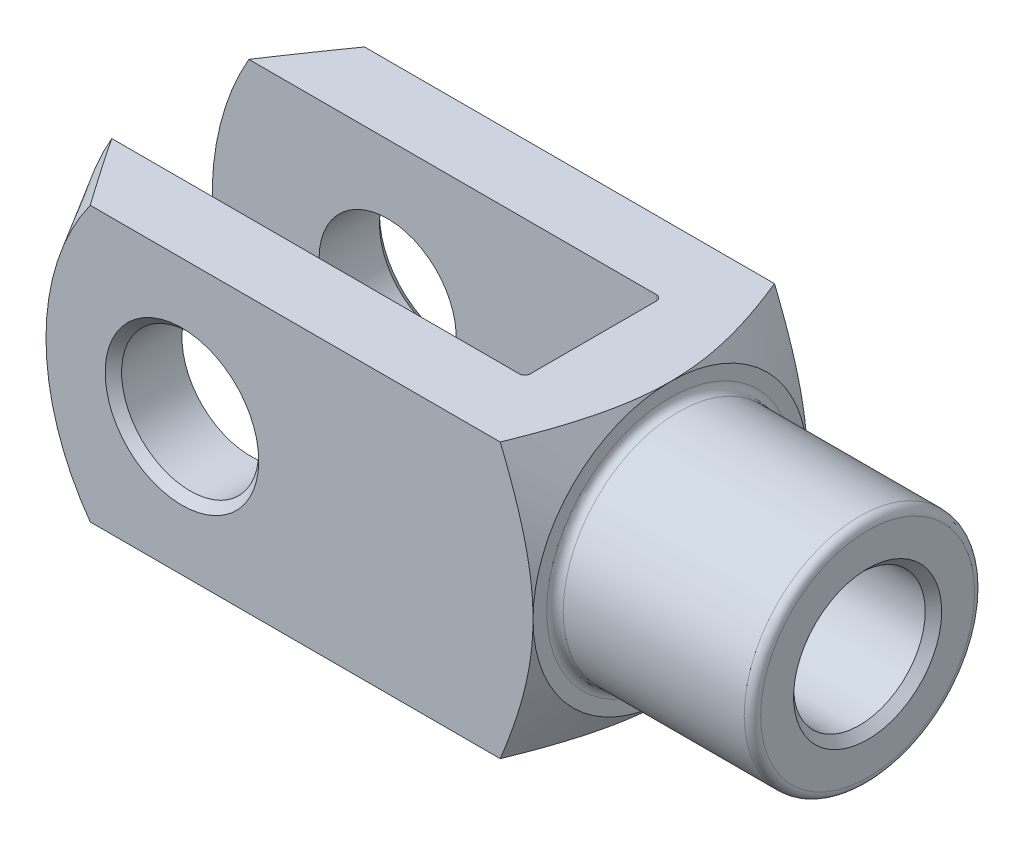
ISO-10303-21;
HEADER;
FILE_DESCRIPTION(('STEP AP214'),'2;1');
FILE_NAME('part.step','',(''),(''),'','','');
FILE_SCHEMA(('AUTOMOTIVE_DESIGN { 1 0 10303 214 1 1 1 1 }'));
ENDSEC;
DATA;
#1=APPLICATION_CONTEXT('core data for automotive mechanical design processes');
#2=APPLICATION_PROTOCOL_DEFINITION('international standard','automotive_design',2000,#1);
#3=PRODUCT_CONTEXT('',#1,'mechanical');
#4=PRODUCT('Part','Part','',(#3));
#5=PRODUCT_RELATED_PRODUCT_CATEGORY('part','',(#4));
#6=PRODUCT_DEFINITION_FORMATION('','',#4);
#7=PRODUCT_DEFINITION_CONTEXT('part definition',#1,'design');
#8=PRODUCT_DEFINITION('design','',#6,#7);
#9=PRODUCT_DEFINITION_SHAPE('','',#8);
#10=(LENGTH_UNIT() NAMED_UNIT(*) SI_UNIT(.MILLI.,.METRE.));
#11=(NAMED_UNIT(*) PLANE_ANGLE_UNIT() SI_UNIT($,.RADIAN.));
#12=(NAMED_UNIT(*) SI_UNIT($,.STERADIAN.) SOLID_ANGLE_UNIT());
#13=UNCERTAINTY_MEASURE_WITH_UNIT(LENGTH_MEASURE(1.E-05),#10,'distance_accuracy_value','');
#14=(GEOMETRIC_REPRESENTATION_CONTEXT(3) GLOBAL_UNCERTAINTY_ASSIGNED_CONTEXT((#13)) GLOBAL_UNIT_ASSIGNED_CONTEXT((#10,
#11,#12)) REPRESENTATION_CONTEXT('',''));
#15=CARTESIAN_POINT('',(0.,0.,0.));
#16=DIRECTION('',(0.,0.,1.));
#17=DIRECTION('',(1.,0.,0.));
#18=AXIS2_PLACEMENT_3D('',#15,#16,#17);
#19=CARTESIAN_POINT('',(-50.,-25.,-12.5));
#20=DIRECTION('',(1.,0.,0.));
#21=DIRECTION('',(0.,0.,-1.));
#22=AXIS2_PLACEMENT_3D('',#19,#20,#21);
#23=PLANE('',#22);
#24=DIRECTION('',(0.,1.,0.));
#25=VECTOR('',#24,1.);
#26=CARTESIAN_POINT('',(-50.,-25.,-11.5));
#27=LINE('',#26,#25);
#28=CARTESIAN_POINT('',(-50.,25.,-11.5));
#29=VERTEX_POINT('',#28);
#30=CARTESIAN_POINT('',(-50.,3.4278273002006,-11.5));
#31=VERTEX_POINT('',#30);
#32=EDGE_CURVE('E154',#29,#31,#27,.F.);
#33=ORIENTED_EDGE('',*,*,#32,.T.);
#34=CARTESIAN_POINT('',(-50.,0.,0.));
#35=DIRECTION('',(1.,0.,0.));
#36=DIRECTION('',(0.,0.,-1.));
#37=AXIS2_PLACEMENT_3D('',#34,#35,#36);
#38=CIRCLE('',#37,12.);
#39=CARTESIAN_POINT('',(-50.,3.42782730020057,11.5));
#40=VERTEX_POINT('',#39);
#41=EDGE_CURVE('E139',#31,#40,#38,.T.);
#42=ORIENTED_EDGE('',*,*,#41,.T.);
#43=DIRECTION('',(0.,1.,0.));
#44=VECTOR('',#43,1.);
#45=CARTESIAN_POINT('',(-50.,25.,11.5));
#46=LINE('',#45,#44);
#47=CARTESIAN_POINT('',(-50.,25.,11.5));
#48=VERTEX_POINT('',#47);
#49=EDGE_CURVE('E151',#40,#48,#46,.T.);
#50=ORIENTED_EDGE('',*,*,#49,.T.);
#51=DIRECTION('',(0.,0.,-1.));
#52=VECTOR('',#51,1.);
#53=CARTESIAN_POINT('',(-50.,25.,-12.5));
#54=LINE('',#53,#52);
#55=EDGE_CURVE('E328',#48,#29,#54,.T.);
#56=ORIENTED_EDGE('',*,*,#55,.T.);
#57=EDGE_LOOP('',(#33,#42,#50,#56));
#58=FACE_BOUND('',#57,.T.);
#59=ADVANCED_FACE('F37',(#58),#23,.F.);
#60=CARTESIAN_POINT('',(-132.,-25.,-12.5));
#61=DIRECTION('',(0.,0.,-1.));
#62=DIRECTION('',(-1.,0.,0.));
#63=AXIS2_PLACEMENT_3D('',#60,#61,#62);
#64=PLANE('',#63);
#65=CARTESIAN_POINT('',(-100.,0.,-12.5));
#66=DIRECTION('',(0.,0.,-1.));
#67=DIRECTION('',(-1.,0.,0.));
#68=AXIS2_PLACEMENT_3D('',#65,#66,#67);
#69=CIRCLE('',#68,12.5);
#70=CARTESIAN_POINT('',(-112.5,0.,-12.5));
#71=VERTEX_POINT('',#70);
#72=EDGE_CURVE('E357',#71,#71,#69,.F.);
#73=ORIENTED_EDGE('',*,*,#72,.F.);
#74=EDGE_LOOP('',(#73));
#75=FACE_BOUND('',#74,.T.);
#76=DIRECTION('',(-1.,0.,0.));
#77=VECTOR('',#76,1.);
#78=CARTESIAN_POINT('',(-132.,25.,-12.5));
#79=LINE('',#78,#77);
#80=CARTESIAN_POINT('',(-51.,25.,-12.5));
#81=VERTEX_POINT('',#80);
#82=CARTESIAN_POINT('',(-125.301270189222,25.,-12.5));
#83=VERTEX_POINT('',#82);
#84=EDGE_CURVE('E336',#81,#83,#79,.T.);
#85=ORIENTED_EDGE('',*,*,#84,.T.);
#86=CARTESIAN_POINT('',(-82.,0.,-12.5));
#87=DIRECTION('',(0.,0.,1.));
#88=DIRECTION('',(1.,0.,0.));
#89=AXIS2_PLACEMENT_3D('',#86,#87,#88);
#90=CIRCLE('',#89,50.);
#91=CARTESIAN_POINT('',(-125.301270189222,-25.,-12.5));
#92=VERTEX_POINT('',#91);
#93=EDGE_CURVE('E266',#83,#92,#90,.T.);
#94=ORIENTED_EDGE('',*,*,#93,.T.);
#95=DIRECTION('',(-1.,0.,0.));
#96=VECTOR('',#95,1.);
#97=CARTESIAN_POINT('',(-132.,-25.,-12.5));
#98=LINE('',#97,#96);
#99=CARTESIAN_POINT('',(-51.,-25.,-12.5));
#100=VERTEX_POINT('',#99);
#101=EDGE_CURVE('E323',#100,#92,#98,.T.);
#102=ORIENTED_EDGE('',*,*,#101,.F.);
#103=DIRECTION('',(0.,1.,0.));
#104=VECTOR('',#103,1.);
#105=CARTESIAN_POINT('',(-51.,25.,-12.5));
#106=LINE('',#105,#104);
#107=EDGE_CURVE('E177',#100,#81,#106,.T.);
#108=ORIENTED_EDGE('',*,*,#107,.T.);
#109=EDGE_LOOP('',(#85,#94,#102,#108));
#110=FACE_BOUND('',#109,.T.);
#111=ADVANCED_FACE('F366',(#75,#110),#64,.F.);
#112=CARTESIAN_POINT('',(-132.,-25.,12.5));
#113=DIRECTION('',(0.,0.,1.));
#114=DIRECTION('',(1.,0.,0.));
#115=AXIS2_PLACEMENT_3D('',#112,#113,#114);
#116=PLANE('',#115);
#117=CARTESIAN_POINT('',(-100.,0.,12.5));
#118=DIRECTION('',(0.,0.,1.));
#119=DIRECTION('',(1.,0.,0.));
#120=AXIS2_PLACEMENT_3D('',#117,#118,#119);
#121=CIRCLE('',#120,12.5);
#122=CARTESIAN_POINT('',(-87.5,0.,12.5));
#123=VERTEX_POINT('',#122);
#124=EDGE_CURVE('E335',#123,#123,#121,.F.);
#125=ORIENTED_EDGE('',*,*,#124,.F.);
#126=EDGE_LOOP('',(#125));
#127=FACE_BOUND('',#126,.T.);
#128=CARTESIAN_POINT('',(-82.,0.,12.5));
#129=DIRECTION('',(0.,0.,1.));
#130=DIRECTION('',(1.,0.,0.));
#131=AXIS2_PLACEMENT_3D('',#128,#129,#130);
#132=CIRCLE('',#131,50.);
#133=CARTESIAN_POINT('',(-125.301270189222,25.,12.5));
#134=VERTEX_POINT('',#133);
#135=CARTESIAN_POINT('',(-125.301270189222,-25.,12.5));
#136=VERTEX_POINT('',#135);
#137=EDGE_CURVE('E396',#134,#136,#132,.T.);
#138=ORIENTED_EDGE('',*,*,#137,.F.);
#139=DIRECTION('',(1.,0.,0.));
#140=VECTOR('',#139,1.);
#141=CARTESIAN_POINT('',(-132.,25.,12.5));
#142=LINE('',#141,#140);
#143=CARTESIAN_POINT('',(-51.,25.,12.5));
#144=VERTEX_POINT('',#143);
#145=EDGE_CURVE('E340',#134,#144,#142,.T.);
#146=ORIENTED_EDGE('',*,*,#145,.T.);
#147=DIRECTION('',(0.,1.,0.));
#148=VECTOR('',#147,1.);
#149=CARTESIAN_POINT('',(-51.,-25.,12.5));
#150=LINE('',#149,#148);
#151=CARTESIAN_POINT('',(-51.,-25.,12.5));
#152=VERTEX_POINT('',#151);
#153=EDGE_CURVE('E168',#144,#152,#150,.F.);
#154=ORIENTED_EDGE('',*,*,#153,.T.);
#155=DIRECTION('',(1.,0.,0.));
#156=VECTOR('',#155,1.);
#157=CARTESIAN_POINT('',(-132.,-25.,12.5));
#158=LINE('',#157,#156);
#159=EDGE_CURVE('E327',#136,#152,#158,.T.);
#160=ORIENTED_EDGE('',*,*,#159,.F.);
#161=EDGE_LOOP('',(#138,#146,#154,#160));
#162=FACE_BOUND('',#161,.T.);
#163=ADVANCED_FACE('F369',(#127,#162),#116,.F.);
#164=CARTESIAN_POINT('',(-132.,-25.,25.));
#165=DIRECTION('',(0.,0.,1.));
#166=DIRECTION('',(1.,0.,0.));
#167=AXIS2_PLACEMENT_3D('',#164,#165,#166);
#168=PLANE('',#167);
#169=CARTESIAN_POINT('',(-100.,0.,25.));
#170=DIRECTION('',(0.,0.,1.));
#171=DIRECTION('',(1.,0.,0.));
#172=AXIS2_PLACEMENT_3D('',#169,#170,#171);
#173=CIRCLE('',#172,14.);
#174=CARTESIAN_POINT('',(-86.,0.,25.));
#175=VERTEX_POINT('',#174);
#176=EDGE_CURVE('E220',#175,#175,#173,.F.);
#177=ORIENTED_EDGE('',*,*,#176,.T.);
#178=EDGE_LOOP('',(#177));
#179=FACE_BOUND('',#178,.T.);
#180=DIRECTION('',(1.,0.,0.));
#181=VECTOR('',#180,1.);
#182=CARTESIAN_POINT('',(-132.,25.,25.));
#183=LINE('',#182,#181);
#184=CARTESIAN_POINT('',(-116.718806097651,25.,25.));
#185=VERTEX_POINT('',#184);
#186=CARTESIAN_POINT('',(-41.9786577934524,25.,25.));
#187=VERTEX_POINT('',#186);
#188=EDGE_CURVE('E354',#185,#187,#183,.T.);
#189=ORIENTED_EDGE('',*,*,#188,.F.);
#190=CARTESIAN_POINT('',(-82.,0.,25.));
#191=DIRECTION('',(0.,0.,1.));
#192=DIRECTION('',(1.,0.,0.));
#193=AXIS2_PLACEMENT_3D('',#190,#191,#192);
#194=CIRCLE('',#193,42.7831216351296);
#195=CARTESIAN_POINT('',(-116.718806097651,-25.,25.));
#196=VERTEX_POINT('',#195);
#197=EDGE_CURVE('E61',#185,#196,#194,.T.);
#198=ORIENTED_EDGE('',*,*,#197,.T.);
#199=DIRECTION('',(1.,0.,0.));
#200=VECTOR('',#199,1.);
#201=CARTESIAN_POINT('',(-132.,-25.,25.));
#202=LINE('',#201,#200);
#203=CARTESIAN_POINT('',(-41.9786577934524,-25.,25.));
#204=VERTEX_POINT('',#203);
#205=EDGE_CURVE('E351',#196,#204,#202,.T.);
#206=ORIENTED_EDGE('',*,*,#205,.T.);
#207=CARTESIAN_POINT('',(-54.3896836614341,-51.060108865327,25.));
#208=CARTESIAN_POINT('',(-54.0702396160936,-50.4440491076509,25.));
#209=CARTESIAN_POINT('',(-53.7516711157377,-49.8275355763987,25.));
#210=CARTESIAN_POINT('',(-53.1164723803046,-48.5935084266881,25.));
#211=CARTESIAN_POINT('',(-52.7998421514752,-47.9759948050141,25.));
#212=CARTESIAN_POINT('',(-51.8531108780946,-46.121758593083,25.));
#213=CARTESIAN_POINT('',(-51.2262015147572,-44.883402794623,25.));
#214=CARTESIAN_POINT('',(-49.9817262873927,-42.3993024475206,25.));
#215=CARTESIAN_POINT('',(-49.36417859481,-41.1535487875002,25.));
#216=CARTESIAN_POINT('',(-48.1420641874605,-38.6556994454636,25.));
#217=CARTESIAN_POINT('',(-47.5374972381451,-37.4036038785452,25.));
#218=CARTESIAN_POINT('',(-46.6245616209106,-35.4809975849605,25.));
#219=CARTESIAN_POINT('',(-46.3103202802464,-34.8132740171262,25.));
#220=CARTESIAN_POINT('',(-45.6870848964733,-33.4753840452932,25.));
#221=CARTESIAN_POINT('',(-45.3780908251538,-32.8052176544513,25.));
#222=CARTESIAN_POINT('',(-44.7660612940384,-31.4621154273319,25.));
#223=CARTESIAN_POINT('',(-44.4630262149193,-30.7891794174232,25.));
#224=CARTESIAN_POINT('',(-43.8638047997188,-29.4402678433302,25.));
#225=CARTESIAN_POINT('',(-43.567618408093,-28.7642923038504,25.));
#226=CARTESIAN_POINT('',(-42.9832401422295,-27.4092342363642,25.));
#227=CARTESIAN_POINT('',(-42.6950448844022,-26.7301531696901,25.));
#228=CARTESIAN_POINT('',(-42.1277277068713,-25.3682139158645,25.));
#229=CARTESIAN_POINT('',(-41.8486056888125,-24.6853557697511,25.));
#230=CARTESIAN_POINT('',(-41.3008836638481,-23.3154936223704,25.));
#231=CARTESIAN_POINT('',(-41.0322827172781,-22.6284899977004,25.));
#232=CARTESIAN_POINT('',(-40.5072699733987,-21.2498439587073,25.));
#233=CARTESIAN_POINT('',(-40.2508580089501,-20.5582016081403,25.));
#234=CARTESIAN_POINT('',(-39.6981186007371,-19.0192644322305,25.));
#235=CARTESIAN_POINT('',(-39.4051931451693,-18.1707404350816,25.));
#236=CARTESIAN_POINT('',(-38.8445496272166,-16.4654408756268,25.));
#237=CARTESIAN_POINT('',(-38.5768294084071,-15.6086660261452,25.));
#238=CARTESIAN_POINT('',(-38.0715655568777,-13.8862208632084,25.));
#239=CARTESIAN_POINT('',(-37.8340212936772,-13.020550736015,25.));
#240=CARTESIAN_POINT('',(-37.3947833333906,-11.2800851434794,25.));
#241=CARTESIAN_POINT('',(-37.1930892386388,-10.4052897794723,25.));
#242=CARTESIAN_POINT('',(-36.8358725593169,-8.66764738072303,25.));
#243=CARTESIAN_POINT('',(-36.6793772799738,-7.8050019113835,25.));
#244=CARTESIAN_POINT('',(-36.4118970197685,-6.07256603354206,25.));
#245=CARTESIAN_POINT('',(-36.3009105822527,-5.20277585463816,25.));
#246=CARTESIAN_POINT('',(-36.1719961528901,-3.89473366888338,25.));
#247=CARTESIAN_POINT('',(-36.1352902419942,-3.45827475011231,25.));
#248=CARTESIAN_POINT('',(-36.0747637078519,-2.58447126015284,25.));
#249=CARTESIAN_POINT('',(-36.0509424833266,-2.14712673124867,25.));
#250=CARTESIAN_POINT('',(-36.0164702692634,-1.27191768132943,25.));
#251=CARTESIAN_POINT('',(-36.0058192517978,-0.834053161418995,25.));
#252=CARTESIAN_POINT('',(-35.997804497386,0.041783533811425,25.));
#253=CARTESIAN_POINT('',(-36.0004406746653,0.4797557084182,25.));
#254=CARTESIAN_POINT('',(-36.0269227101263,1.72941799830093,25.));
#255=CARTESIAN_POINT('',(-36.0669600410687,2.54082045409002,25.));
#256=CARTESIAN_POINT('',(-36.191134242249,4.16015553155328,25.));
#257=CARTESIAN_POINT('',(-36.2752710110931,4.96808816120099,25.));
#258=CARTESIAN_POINT('',(-36.4845414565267,6.57900346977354,25.));
#259=CARTESIAN_POINT('',(-36.6096963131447,7.381983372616,25.));
#260=CARTESIAN_POINT('',(-36.8968815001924,8.9812761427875,25.));
#261=CARTESIAN_POINT('',(-37.0589128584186,9.77758882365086,25.));
#262=CARTESIAN_POINT('',(-37.4205003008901,11.3858202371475,25.));
#263=CARTESIAN_POINT('',(-37.6210067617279,12.1975235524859,25.));
#264=CARTESIAN_POINT('',(-38.0514548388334,13.8130498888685,25.));
#265=CARTESIAN_POINT('',(-38.2813967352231,14.6168728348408,25.));
#266=CARTESIAN_POINT('',(-38.6450498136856,15.8168480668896,25.));
#267=CARTESIAN_POINT('',(-38.7693896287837,16.2158762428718,25.));
#268=CARTESIAN_POINT('',(-39.0238248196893,17.0120965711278,25.));
#269=CARTESIAN_POINT('',(-39.1539201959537,17.4092887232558,25.));
#270=CARTESIAN_POINT('',(-39.4193862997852,18.2018774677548,25.));
#271=CARTESIAN_POINT('',(-39.5547567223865,18.5972741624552,25.));
#272=CARTESIAN_POINT('',(-39.8303487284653,19.3863688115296,25.));
#273=CARTESIAN_POINT('',(-39.9705702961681,19.7800667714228,25.));
#274=CARTESIAN_POINT('',(-40.4211198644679,21.0227726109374,25.));
#275=CARTESIAN_POINT('',(-40.7396291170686,21.8688223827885,25.));
#276=CARTESIAN_POINT('',(-41.3939408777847,23.5542282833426,25.));
#277=CARTESIAN_POINT('',(-41.7297444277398,24.3935840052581,25.));
#278=CARTESIAN_POINT('',(-42.4158526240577,26.0665557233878,25.));
#279=CARTESIAN_POINT('',(-42.7661605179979,26.9001703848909,25.));
#280=CARTESIAN_POINT('',(-43.4788643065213,28.5621850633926,25.));
#281=CARTESIAN_POINT('',(-43.8412599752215,29.3905851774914,25.));
#282=CARTESIAN_POINT('',(-44.5765639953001,31.0435554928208,25.));
#283=CARTESIAN_POINT('',(-44.9494811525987,31.8681217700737,25.));
#284=CARTESIAN_POINT('',(-45.7039754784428,33.5132807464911,25.));
#285=CARTESIAN_POINT('',(-46.0855526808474,34.3338734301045,25.));
#286=CARTESIAN_POINT('',(-46.8560487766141,35.9714875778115,25.));
#287=CARTESIAN_POINT('',(-47.2449668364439,36.7885094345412,25.));
#288=CARTESIAN_POINT('',(-48.0291380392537,38.4195026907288,25.));
#289=CARTESIAN_POINT('',(-48.4243911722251,39.2334740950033,25.));
#290=CARTESIAN_POINT('',(-49.2215760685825,40.8612119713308,25.));
#291=CARTESIAN_POINT('',(-49.6235245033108,41.6749702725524,25.));
#292=CARTESIAN_POINT('',(-50.4321982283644,43.3001111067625,25.));
#293=CARTESIAN_POINT('',(-50.8389235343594,44.1114936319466,25.));
#294=CARTESIAN_POINT('',(-52.0653366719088,46.542528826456,25.));
#295=CARTESIAN_POINT('',(-52.8912486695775,48.1590425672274,25.));
#296=CARTESIAN_POINT('',(-54.5554400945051,51.3846655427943,25.));
#297=CARTESIAN_POINT('',(-55.3937132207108,52.993778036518,25.));
#298=CARTESIAN_POINT('',(-57.0803096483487,56.206707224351,25.));
#299=CARTESIAN_POINT('',(-57.9286328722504,57.810523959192,25.));
#300=CARTESIAN_POINT('',(-59.5067418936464,60.7760111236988,25.));
#301=CARTESIAN_POINT('',(-60.2354219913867,62.1382706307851,25.));
#302=CARTESIAN_POINT('',(-61.6976641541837,64.8601683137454,25.));
#303=CARTESIAN_POINT('',(-62.431226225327,66.2198064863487,25.));
#304=CARTESIAN_POINT('',(-63.9025703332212,68.9370430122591,25.));
#305=CARTESIAN_POINT('',(-64.6403529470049,70.2946410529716,25.));
#306=CARTESIAN_POINT('',(-66.1194235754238,73.0079264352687,25.));
#307=CARTESIAN_POINT('',(-66.8607115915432,74.363613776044,25.));
#308=CARTESIAN_POINT('',(-68.3420387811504,77.0655790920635,25.));
#309=CARTESIAN_POINT('',(-69.0820607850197,78.4118664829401,25.));
#310=CARTESIAN_POINT('',(-70.5646748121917,81.1030256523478,25.));
#311=CARTESIAN_POINT('',(-71.3072668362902,82.4478974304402,25.));
#312=CARTESIAN_POINT('',(-72.7945668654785,85.1361925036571,25.));
#313=CARTESIAN_POINT('',(-73.5392745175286,86.4796159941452,25.));
#314=CARTESIAN_POINT('',(-75.0306524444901,89.1653712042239,25.));
#315=CARTESIAN_POINT('',(-75.7773227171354,90.5077029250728,25.));
#316=CARTESIAN_POINT('',(-76.5248400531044,91.8495622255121,25.));
#317=B_SPLINE_CURVE_WITH_KNOTS('',3,(#207,#208,#209,#210,#211,#212,#213,#214,#215,#216,#217,
#218,#219,#220,#221,#222,#223,#224,#225,#226,#227,#228,#229,#230,#231,#232,#233,#234,#235,#236,
#237,#238,#239,#240,#241,#242,#243,#244,#245,#246,#247,#248,#249,#250,#251,#252,#253,#254,#255,
#256,#257,#258,#259,#260,#261,#262,#263,#264,#265,#266,#267,#268,#269,#270,#271,#272,#273,#274,
#275,#276,#277,#278,#279,#280,#281,#282,#283,#284,#285,#286,#287,#288,#289,#290,#291,#292,#293,
#294,#295,#296,#297,#298,#299,#300,#301,#302,#303,#304,#305,#306,#307,#308,#309,#310,#311,#312,
#313,#314,#315,#316),.UNSPECIFIED.,.F.,.F.,(4,2,2,2,2,2,2,2,2,2,2,2,2,2,2,2,2,2,2,2,2,2,2,2,2,2,
2,2,2,2,2,2,2,2,2,2,2,2,2,2,2,2,2,2,2,2,2,2,2,2,2,2,2,2,4),(0.,2.0818647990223,4.16373630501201,
8.3276893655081,12.4988933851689,16.6700219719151,18.8839190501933,21.0978042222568,
23.3118303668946,25.5258385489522,27.7388945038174,29.9519264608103,32.1647603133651,
34.3775638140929,37.0702188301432,39.7626432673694,42.4550114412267,45.1473497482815,
47.7764878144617,50.4055417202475,51.7193813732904,53.0331597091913,54.3469352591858,
55.6607023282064,58.0965060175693,60.5323041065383,62.969361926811,65.4064876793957,
67.9141539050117,70.4218439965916,71.6756655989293,72.9294873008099,74.1832366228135,
75.4369818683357,78.1487780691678,80.8607378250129,83.5733081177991,86.2858277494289,
89.0006892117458,91.7155612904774,94.4301269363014,97.1446882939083,99.8675153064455,
102.59035125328,108.03611189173,113.479186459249,118.922219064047,123.556917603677,
128.191621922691,132.826975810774,137.462331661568,142.071135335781,146.679940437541,
151.288017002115,155.896088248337),.UNSPECIFIED.);
#318=CARTESIAN_POINT('',(-36.,0.,25.));
#319=VERTEX_POINT('',#318);
#320=EDGE_CURVE('E295',#319,#204,#317,.F.);
#321=ORIENTED_EDGE('',*,*,#320,.F.);
#322=EDGE_CURVE('E293',#187,#319,#317,.F.);
#323=ORIENTED_EDGE('',*,*,#322,.F.);
#324=EDGE_LOOP('',(#189,#198,#206,#321,#323));
#325=FACE_BOUND('',#324,.T.);
#326=ADVANCED_FACE('F277',(#179,#325),#168,.T.);
#327=CARTESIAN_POINT('',(-132.,-25.,25.));
#328=DIRECTION('',(0.,-1.,0.));
#329=DIRECTION('',(0.,0.,-1.));
#330=AXIS2_PLACEMENT_3D('',#327,#328,#329);
#331=PLANE('',#330);
#332=ORIENTED_EDGE('',*,*,#101,.T.);
#333=CARTESIAN_POINT('',(-145.080288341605,-25.,18.4234921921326));
#334=CARTESIAN_POINT('',(-144.472127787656,-25.,17.4442349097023));
#335=CARTESIAN_POINT('',(-143.863110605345,-25.,16.4655096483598));
#336=CARTESIAN_POINT('',(-142.64320100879,-25.,14.5092279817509));
#337=CARTESIAN_POINT('',(-142.032308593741,-25.,13.5316715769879));
#338=CARTESIAN_POINT('',(-140.196552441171,-25.,10.6008760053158));
#339=CARTESIAN_POINT('',(-138.968633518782,-25.,8.64954870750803));
#340=CARTESIAN_POINT('',(-136.501582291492,-25.,4.75072735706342));
#341=CARTESIAN_POINT('',(-135.262438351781,-25.,2.80324065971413));
#342=CARTESIAN_POINT('',(-133.394839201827,-25.,-0.112283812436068));
#343=CARTESIAN_POINT('',(-132.770828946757,-25.,-1.08316923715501));
#344=CARTESIAN_POINT('',(-131.519511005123,-25.,-3.02282119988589));
#345=CARTESIAN_POINT('',(-130.892203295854,-25.,-3.99158772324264));
#346=CARTESIAN_POINT('',(-128.95244702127,-25.,-6.97489606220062));
#347=CARTESIAN_POINT('',(-127.633918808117,-25.,-8.98549817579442));
#348=CARTESIAN_POINT('',(-125.641173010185,-25.,-11.9914731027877));
#349=CARTESIAN_POINT('',(-124.974434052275,-25.,-12.9918072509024));
#350=CARTESIAN_POINT('',(-123.635287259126,-25.,-14.9886724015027));
#351=CARTESIAN_POINT('',(-122.962879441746,-25.,-15.9852034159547));
#352=CARTESIAN_POINT('',(-121.612110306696,-25.,-17.9731515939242));
#353=CARTESIAN_POINT('',(-120.93375374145,-25.,-18.9645719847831));
#354=CARTESIAN_POINT('',(-119.569655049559,-25.,-20.9423259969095));
#355=CARTESIAN_POINT('',(-118.883912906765,-25.,-21.9286596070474));
#356=CARTESIAN_POINT('',(-117.503939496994,-25.,-23.8953083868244));
#357=CARTESIAN_POINT('',(-116.809708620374,-25.,-24.8756238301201));
#358=CARTESIAN_POINT('',(-115.411345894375,-25.,-26.8291605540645));
#359=CARTESIAN_POINT('',(-114.707214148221,-25.,-27.8023819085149));
#360=CARTESIAN_POINT('',(-113.293944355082,-25.,-29.7312915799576));
#361=CARTESIAN_POINT('',(-112.584914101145,-25.,-30.6870587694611));
#362=CARTESIAN_POINT('',(-111.153353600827,-25.,-32.588477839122));
#363=CARTESIAN_POINT('',(-110.430823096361,-25.,-33.5341295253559));
#364=CARTESIAN_POINT('',(-108.968647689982,-25.,-35.4142141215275));
#365=CARTESIAN_POINT('',(-108.228980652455,-25.,-36.3486298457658));
#366=CARTESIAN_POINT('',(-106.730154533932,-25.,-38.2016880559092));
#367=CARTESIAN_POINT('',(-105.970996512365,-25.,-39.1203313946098));
#368=CARTESIAN_POINT('',(-104.818318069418,-25.,-40.4783705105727));
#369=CARTESIAN_POINT('',(-104.433821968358,-25.,-40.9254343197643));
#370=CARTESIAN_POINT('',(-103.658306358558,-25.,-41.8138621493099));
#371=CARTESIAN_POINT('',(-103.267286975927,-25.,-42.2552262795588));
#372=CARTESIAN_POINT('',(-102.477863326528,-25.,-43.1315371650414));
#373=CARTESIAN_POINT('',(-102.07945697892,-25.,-43.5664820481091));
#374=CARTESIAN_POINT('',(-101.274508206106,-25.,-44.4287818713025));
#375=CARTESIAN_POINT('',(-100.867965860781,-25.,-44.8561368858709));
#376=CARTESIAN_POINT('',(-100.046668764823,-25.,-45.701042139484));
#377=CARTESIAN_POINT('',(-99.6319344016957,-25.,-46.1186121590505));
#378=CARTESIAN_POINT('',(-98.7922215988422,-25.,-46.9433872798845));
#379=CARTESIAN_POINT('',(-98.3672426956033,-25.,-47.3505919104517));
#380=CARTESIAN_POINT('',(-97.5060078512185,-25.,-48.1524328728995));
#381=CARTESIAN_POINT('',(-97.0697583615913,-25.,-48.5470761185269));
#382=CARTESIAN_POINT('',(-96.1843373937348,-25.,-49.3215389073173));
#383=CARTESIAN_POINT('',(-95.7351678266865,-25.,-49.7013606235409));
#384=CARTESIAN_POINT('',(-95.0423543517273,-25.,-50.2642508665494));
#385=CARTESIAN_POINT('',(-94.8040357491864,-25.,-50.4538860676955));
#386=CARTESIAN_POINT('',(-94.3232489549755,-25.,-50.8278161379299));
#387=CARTESIAN_POINT('',(-94.0807807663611,-25.,-51.0121110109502));
#388=CARTESIAN_POINT('',(-93.3466799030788,-25.,-51.5562074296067));
#389=CARTESIAN_POINT('',(-92.8484147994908,-25.,-51.9071684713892));
#390=CARTESIAN_POINT('',(-91.8327862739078,-25.,-52.579524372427));
#391=CARTESIAN_POINT('',(-91.3154382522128,-25.,-52.9009423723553));
#392=CARTESIAN_POINT('',(-90.2597150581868,-25.,-53.5073081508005));
#393=CARTESIAN_POINT('',(-89.721345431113,-25.,-53.7922654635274));
#394=CARTESIAN_POINT('',(-88.7482738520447,-25.,-54.2570284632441));
#395=CARTESIAN_POINT('',(-88.3179565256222,-25.,-54.4459895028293));
#396=CARTESIAN_POINT('',(-87.4447220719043,-25.,-54.7923456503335));
#397=CARTESIAN_POINT('',(-87.0018060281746,-25.,-54.9497434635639));
#398=CARTESIAN_POINT('',(-86.1052102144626,-25.,-55.2279936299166));
#399=CARTESIAN_POINT('',(-85.6515463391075,-25.,-55.3488967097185));
#400=CARTESIAN_POINT('',(-84.7352048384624,-25.,-55.5499885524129));
#401=CARTESIAN_POINT('',(-84.2725276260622,-25.,-55.63017917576));
#402=CARTESIAN_POINT('',(-83.3369335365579,-25.,-55.7469995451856));
#403=CARTESIAN_POINT('',(-82.863960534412,-25.,-55.7831858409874));
#404=CARTESIAN_POINT('',(-81.9167547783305,-25.,-55.8087980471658));
#405=CARTESIAN_POINT('',(-81.4425220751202,-25.,-55.7982258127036));
#406=CARTESIAN_POINT('',(-80.4972968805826,-25.,-55.7308315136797));
#407=CARTESIAN_POINT('',(-80.0263050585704,-25.,-55.6740001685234));
#408=CARTESIAN_POINT('',(-79.0916982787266,-25.,-55.5167043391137));
#409=CARTESIAN_POINT('',(-78.6280844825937,-25.,-55.4162330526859));
#410=CARTESIAN_POINT('',(-77.6263398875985,-25.,-55.1534627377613));
#411=CARTESIAN_POINT('',(-77.0903179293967,-25.,-54.9831572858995));
#412=CARTESIAN_POINT('',(-76.0358435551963,-25.,-54.5950590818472));
#413=CARTESIAN_POINT('',(-75.5173965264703,-25.,-54.3772519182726));
#414=CARTESIAN_POINT('',(-74.4975214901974,-25.,-53.9014837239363));
#415=CARTESIAN_POINT('',(-73.9961502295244,-25.,-53.6434022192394));
#416=CARTESIAN_POINT('',(-73.0117477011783,-25.,-53.0947741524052));
#417=CARTESIAN_POINT('',(-72.5287143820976,-25.,-52.8042312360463));
#418=CARTESIAN_POINT('',(-71.4240950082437,-25.,-52.0970110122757));
#419=CARTESIAN_POINT('',(-70.809011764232,-25.,-51.6702126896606));
#420=CARTESIAN_POINT('',(-69.6052253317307,-25.,-50.7806794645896));
#421=CARTESIAN_POINT('',(-69.0165360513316,-25.,-50.3179259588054));
#422=CARTESIAN_POINT('',(-67.86112354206,-25.,-49.3637360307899));
#423=CARTESIAN_POINT('',(-67.2944444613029,-25.,-48.8722464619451));
#424=CARTESIAN_POINT('',(-66.1810865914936,-25.,-47.8674233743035));
#425=CARTESIAN_POINT('',(-65.6344043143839,-25.,-47.3540936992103));
#426=CARTESIAN_POINT('',(-64.5545082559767,-25.,-46.3064086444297));
#427=CARTESIAN_POINT('',(-64.0214091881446,-25.,-45.7719354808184));
#428=CARTESIAN_POINT('',(-62.97007006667,-25.,-44.6885777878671));
#429=CARTESIAN_POINT('',(-62.4518305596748,-25.,-44.1396927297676));
#430=CARTESIAN_POINT('',(-61.4287324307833,-25.,-43.0306741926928));
#431=CARTESIAN_POINT('',(-60.9238604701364,-25.,-42.4705529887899));
#432=CARTESIAN_POINT('',(-59.9252668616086,-25.,-41.3405006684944));
#433=CARTESIAN_POINT('',(-59.4315449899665,-25.,-40.7705697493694));
#434=CARTESIAN_POINT('',(-58.2511889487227,-25.,-39.3845205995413));
#435=CARTESIAN_POINT('',(-57.5694107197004,-25.,-38.5642689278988));
#436=CARTESIAN_POINT('',(-56.2219000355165,-25.,-36.9104674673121));
#437=CARTESIAN_POINT('',(-55.5561707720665,-25.,-36.0769150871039));
#438=CARTESIAN_POINT('',(-54.2484285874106,-25.,-34.4119795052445));
#439=CARTESIAN_POINT('',(-53.6062085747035,-25.,-33.5807587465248));
#440=CARTESIAN_POINT('',(-52.6514215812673,-25.,-32.3276338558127));
#441=CARTESIAN_POINT('',(-52.3346290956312,-25.,-31.9089387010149));
#442=CARTESIAN_POINT('',(-51.703658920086,-25.,-31.0695887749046));
#443=CARTESIAN_POINT('',(-51.3894812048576,-25.,-30.6489340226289));
#444=CARTESIAN_POINT('',(-51.0765078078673,-25.,-30.2273844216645));
#445=B_SPLINE_CURVE_WITH_KNOTS('',3,(#333,#334,#335,#336,#337,#338,#339,#340,#341,#342,#343,
#344,#345,#346,#347,#348,#349,#350,#351,#352,#353,#354,#355,#356,#357,#358,#359,#360,#361,#362,
#363,#364,#365,#366,#367,#368,#369,#370,#371,#372,#373,#374,#375,#376,#377,#378,#379,#380,#381,
#382,#383,#384,#385,#386,#387,#388,#389,#390,#391,#392,#393,#394,#395,#396,#397,#398,#399,#400,
#401,#402,#403,#404,#405,#406,#407,#408,#409,#410,#411,#412,#413,#414,#415,#416,#417,#418,#419,
#420,#421,#422,#423,#424,#425,#426,#427,#428,#429,#430,#431,#432,#433,#434,#435,#436,#437,#438,
#439,#440,#441,#442,#443,#444),.UNSPECIFIED.,.F.,.F.,(4,2,2,2,2,2,2,2,2,2,2,2,2,2,2,2,2,2,2,2,2,
2,2,2,2,2,2,2,2,2,2,2,2,2,2,2,2,2,2,2,2,2,2,2,2,2,2,2,2,2,2,2,2,2,2,4),(0.,3.45821226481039,
6.91642601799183,13.8329884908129,20.7578064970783,24.2201787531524,27.6825748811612,
34.8955969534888,38.5020877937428,42.1085672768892,45.7123890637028,49.3162187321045,
52.9198832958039,56.5235103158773,60.0935571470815,63.6636722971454,67.2386891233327,
70.8135120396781,72.5824521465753,74.3513580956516,76.1207701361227,77.890164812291,
79.6556045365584,81.4211242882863,83.1856548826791,84.9499257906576,85.863540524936,
86.7771545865,88.6046301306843,90.4306618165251,92.2562150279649,93.665101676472,
95.0738675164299,96.4806660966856,97.8874003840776,99.3081964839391,100.728936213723,
102.149961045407,103.57120745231,105.255783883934,106.940872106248,108.63110118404,
110.321140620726,112.565337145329,114.810702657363,117.060361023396,119.309625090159,
121.57395208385,123.838362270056,126.100420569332,128.362433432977,131.56196291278,
134.762123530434,137.913252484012,139.488353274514,141.063438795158),.UNSPECIFIED.);
#446=CARTESIAN_POINT('',(-116.718806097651,-25.,-25.));
#447=VERTEX_POINT('',#446);
#448=EDGE_CURVE('E265',#92,#447,#445,.T.);
#449=ORIENTED_EDGE('',*,*,#448,.T.);
#450=DIRECTION('',(1.,0.,0.));
#451=VECTOR('',#450,1.);
#452=CARTESIAN_POINT('',(-132.,-25.,-25.));
#453=LINE('',#452,#451);
#454=CARTESIAN_POINT('',(-41.9786577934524,-25.,-25.));
#455=VERTEX_POINT('',#454);
#456=EDGE_CURVE('E348',#447,#455,#453,.T.);
#457=ORIENTED_EDGE('',*,*,#456,.T.);
#458=CARTESIAN_POINT('',(-54.3896836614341,-25.,-51.060108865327));
#459=CARTESIAN_POINT('',(-54.0702396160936,-25.,-50.4440491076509));
#460=CARTESIAN_POINT('',(-53.7516711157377,-25.,-49.8275355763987));
#461=CARTESIAN_POINT('',(-53.1164723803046,-25.,-48.5935084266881));
#462=CARTESIAN_POINT('',(-52.7998421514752,-25.,-47.9759948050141));
#463=CARTESIAN_POINT('',(-51.8531108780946,-25.,-46.121758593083));
#464=CARTESIAN_POINT('',(-51.2262015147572,-25.,-44.883402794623));
#465=CARTESIAN_POINT('',(-49.9817262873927,-25.,-42.3993024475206));
#466=CARTESIAN_POINT('',(-49.36417859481,-25.,-41.1535487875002));
#467=CARTESIAN_POINT('',(-48.1420641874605,-25.,-38.6556994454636));
#468=CARTESIAN_POINT('',(-47.5374972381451,-25.,-37.4036038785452));
#469=CARTESIAN_POINT('',(-46.6245616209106,-25.,-35.4809975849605));
#470=CARTESIAN_POINT('',(-46.3103202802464,-25.,-34.8132740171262));
#471=CARTESIAN_POINT('',(-45.6870848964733,-25.,-33.4753840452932));
#472=CARTESIAN_POINT('',(-45.3780908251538,-25.,-32.8052176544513));
#473=CARTESIAN_POINT('',(-44.7660612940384,-25.,-31.4621154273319));
#474=CARTESIAN_POINT('',(-44.4630262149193,-25.,-30.7891794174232));
#475=CARTESIAN_POINT('',(-43.8638047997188,-25.,-29.4402678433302));
#476=CARTESIAN_POINT('',(-43.567618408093,-25.,-28.7642923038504));
#477=CARTESIAN_POINT('',(-42.9832401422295,-25.,-27.4092342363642));
#478=CARTESIAN_POINT('',(-42.6950448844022,-25.,-26.7301531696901));
#479=CARTESIAN_POINT('',(-42.1277277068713,-25.,-25.3682139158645));
#480=CARTESIAN_POINT('',(-41.8486056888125,-25.,-24.6853557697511));
#481=CARTESIAN_POINT('',(-41.3008836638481,-25.,-23.3154936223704));
#482=CARTESIAN_POINT('',(-41.0322827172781,-25.,-22.6284899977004));
#483=CARTESIAN_POINT('',(-40.5072699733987,-25.,-21.2498439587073));
#484=CARTESIAN_POINT('',(-40.2508580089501,-25.,-20.5582016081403));
#485=CARTESIAN_POINT('',(-39.6981186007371,-25.,-19.0192644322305));
#486=CARTESIAN_POINT('',(-39.4051931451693,-25.,-18.1707404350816));
#487=CARTESIAN_POINT('',(-38.8445496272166,-25.,-16.4654408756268));
#488=CARTESIAN_POINT('',(-38.5768294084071,-25.,-15.6086660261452));
#489=CARTESIAN_POINT('',(-38.0715655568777,-25.,-13.8862208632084));
#490=CARTESIAN_POINT('',(-37.8340212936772,-25.,-13.020550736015));
#491=CARTESIAN_POINT('',(-37.3947833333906,-25.,-11.2800851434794));
#492=CARTESIAN_POINT('',(-37.1930892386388,-25.,-10.4052897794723));
#493=CARTESIAN_POINT('',(-36.8358725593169,-25.,-8.66764738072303));
#494=CARTESIAN_POINT('',(-36.6793772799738,-25.,-7.8050019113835));
#495=CARTESIAN_POINT('',(-36.4118970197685,-25.,-6.07256603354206));
#496=CARTESIAN_POINT('',(-36.3009105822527,-25.,-5.20277585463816));
#497=CARTESIAN_POINT('',(-36.1719961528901,-25.,-3.89473366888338));
#498=CARTESIAN_POINT('',(-36.1352902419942,-25.,-3.45827475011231));
#499=CARTESIAN_POINT('',(-36.0747637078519,-25.,-2.58447126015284));
#500=CARTESIAN_POINT('',(-36.0509424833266,-25.,-2.14712673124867));
#501=CARTESIAN_POINT('',(-36.0164702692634,-25.,-1.27191768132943));
#502=CARTESIAN_POINT('',(-36.0058192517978,-25.,-0.834053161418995));
#503=CARTESIAN_POINT('',(-35.997804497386,-25.,0.041783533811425));
#504=CARTESIAN_POINT('',(-36.0004406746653,-25.,0.4797557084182));
#505=CARTESIAN_POINT('',(-36.0269227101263,-25.,1.72941799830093));
#506=CARTESIAN_POINT('',(-36.0669600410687,-25.,2.54082045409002));
#507=CARTESIAN_POINT('',(-36.191134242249,-25.,4.16015553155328));
#508=CARTESIAN_POINT('',(-36.2752710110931,-25.,4.96808816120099));
#509=CARTESIAN_POINT('',(-36.4845414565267,-25.,6.57900346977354));
#510=CARTESIAN_POINT('',(-36.6096963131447,-25.,7.381983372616));
#511=CARTESIAN_POINT('',(-36.8968815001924,-25.,8.9812761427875));
#512=CARTESIAN_POINT('',(-37.0589128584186,-25.,9.77758882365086));
#513=CARTESIAN_POINT('',(-37.4205003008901,-25.,11.3858202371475));
#514=CARTESIAN_POINT('',(-37.6210067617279,-25.,12.1975235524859));
#515=CARTESIAN_POINT('',(-38.0514548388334,-25.,13.8130498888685));
#516=CARTESIAN_POINT('',(-38.2813967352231,-25.,14.6168728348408));
#517=CARTESIAN_POINT('',(-38.6450498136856,-25.,15.8168480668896));
#518=CARTESIAN_POINT('',(-38.7693896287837,-25.,16.2158762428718));
#519=CARTESIAN_POINT('',(-39.0238248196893,-25.,17.0120965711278));
#520=CARTESIAN_POINT('',(-39.1539201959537,-25.,17.4092887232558));
#521=CARTESIAN_POINT('',(-39.4193862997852,-25.,18.2018774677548));
#522=CARTESIAN_POINT('',(-39.5547567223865,-25.,18.5972741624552));
#523=CARTESIAN_POINT('',(-39.8303487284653,-25.,19.3863688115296));
#524=CARTESIAN_POINT('',(-39.9705702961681,-25.,19.7800667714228));
#525=CARTESIAN_POINT('',(-40.4211198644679,-25.,21.0227726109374));
#526=CARTESIAN_POINT('',(-40.7396291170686,-25.,21.8688223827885));
#527=CARTESIAN_POINT('',(-41.3939408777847,-25.,23.5542282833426));
#528=CARTESIAN_POINT('',(-41.7297444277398,-25.,24.3935840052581));
#529=CARTESIAN_POINT('',(-42.4158526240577,-25.,26.0665557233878));
#530=CARTESIAN_POINT('',(-42.7661605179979,-25.,26.9001703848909));
#531=CARTESIAN_POINT('',(-43.4788643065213,-25.,28.5621850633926));
#532=CARTESIAN_POINT('',(-43.8412599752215,-25.,29.3905851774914));
#533=CARTESIAN_POINT('',(-44.5765639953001,-25.,31.0435554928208));
#534=CARTESIAN_POINT('',(-44.9494811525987,-25.,31.8681217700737));
#535=CARTESIAN_POINT('',(-45.7039754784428,-25.,33.5132807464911));
#536=CARTESIAN_POINT('',(-46.0855526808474,-25.,34.3338734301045));
#537=CARTESIAN_POINT('',(-46.8560487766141,-25.,35.9714875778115));
#538=CARTESIAN_POINT('',(-47.2449668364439,-25.,36.7885094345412));
#539=CARTESIAN_POINT('',(-48.0291380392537,-25.,38.4195026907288));
#540=CARTESIAN_POINT('',(-48.4243911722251,-25.,39.2334740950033));
#541=CARTESIAN_POINT('',(-49.2215760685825,-25.,40.8612119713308));
#542=CARTESIAN_POINT('',(-49.6235245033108,-25.,41.6749702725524));
#543=CARTESIAN_POINT('',(-50.4321982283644,-25.,43.3001111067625));
#544=CARTESIAN_POINT('',(-50.8389235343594,-25.,44.1114936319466));
#545=CARTESIAN_POINT('',(-52.0653366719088,-25.,46.542528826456));
#546=CARTESIAN_POINT('',(-52.8912486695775,-25.,48.1590425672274));
#547=CARTESIAN_POINT('',(-54.5554400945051,-25.,51.3846655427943));
#548=CARTESIAN_POINT('',(-55.3937132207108,-25.,52.993778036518));
#549=CARTESIAN_POINT('',(-57.0803096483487,-25.,56.206707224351));
#550=CARTESIAN_POINT('',(-57.9286328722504,-25.,57.810523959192));
#551=CARTESIAN_POINT('',(-59.5067418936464,-25.,60.7760111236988));
#552=CARTESIAN_POINT('',(-60.2354219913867,-25.,62.1382706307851));
#553=CARTESIAN_POINT('',(-61.6976641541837,-25.,64.8601683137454));
#554=CARTESIAN_POINT('',(-62.431226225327,-25.,66.2198064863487));
#555=CARTESIAN_POINT('',(-63.9025703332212,-25.,68.9370430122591));
#556=CARTESIAN_POINT('',(-64.6403529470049,-25.,70.2946410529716));
#557=CARTESIAN_POINT('',(-66.1194235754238,-25.,73.0079264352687));
#558=CARTESIAN_POINT('',(-66.8607115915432,-25.,74.363613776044));
#559=CARTESIAN_POINT('',(-68.3420387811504,-25.,77.0655790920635));
#560=CARTESIAN_POINT('',(-69.0820607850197,-25.,78.4118664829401));
#561=CARTESIAN_POINT('',(-70.5646748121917,-25.,81.1030256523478));
#562=CARTESIAN_POINT('',(-71.3072668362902,-25.,82.4478974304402));
#563=CARTESIAN_POINT('',(-72.7945668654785,-25.,85.1361925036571));
#564=CARTESIAN_POINT('',(-73.5392745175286,-25.,86.4796159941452));
#565=CARTESIAN_POINT('',(-75.0306524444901,-25.,89.1653712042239));
#566=CARTESIAN_POINT('',(-75.7773227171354,-25.,90.5077029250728));
#567=CARTESIAN_POINT('',(-76.5248400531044,-25.,91.8495622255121));
#568=B_SPLINE_CURVE_WITH_KNOTS('',3,(#458,#459,#460,#461,#462,#463,#464,#465,#466,#467,#468,
#469,#470,#471,#472,#473,#474,#475,#476,#477,#478,#479,#480,#481,#482,#483,#484,#485,#486,#487,
#488,#489,#490,#491,#492,#493,#494,#495,#496,#497,#498,#499,#500,#501,#502,#503,#504,#505,#506,
#507,#508,#509,#510,#511,#512,#513,#514,#515,#516,#517,#518,#519,#520,#521,#522,#523,#524,#525,
#526,#527,#528,#529,#530,#531,#532,#533,#534,#535,#536,#537,#538,#539,#540,#541,#542,#543,#544,
#545,#546,#547,#548,#549,#550,#551,#552,#553,#554,#555,#556,#557,#558,#559,#560,#561,#562,#563,
#564,#565,#566,#567),.UNSPECIFIED.,.F.,.F.,(4,2,2,2,2,2,2,2,2,2,2,2,2,2,2,2,2,2,2,2,2,2,2,2,2,2,
2,2,2,2,2,2,2,2,2,2,2,2,2,2,2,2,2,2,2,2,2,2,2,2,2,2,2,2,4),(0.,2.0818647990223,4.16373630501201,
8.3276893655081,12.4988933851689,16.6700219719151,18.8839190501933,21.0978042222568,
23.3118303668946,25.5258385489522,27.7388945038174,29.9519264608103,32.1647603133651,
34.3775638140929,37.0702188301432,39.7626432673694,42.4550114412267,45.1473497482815,
47.7764878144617,50.4055417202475,51.7193813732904,53.0331597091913,54.3469352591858,
55.6607023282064,58.0965060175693,60.5323041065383,62.969361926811,65.4064876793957,
67.9141539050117,70.4218439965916,71.6756655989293,72.9294873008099,74.1832366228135,
75.4369818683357,78.1487780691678,80.8607378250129,83.5733081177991,86.2858277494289,
89.0006892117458,91.7155612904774,94.4301269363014,97.1446882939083,99.8675153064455,
102.59035125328,108.03611189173,113.479186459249,118.922219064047,123.556917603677,
128.191621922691,132.826975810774,137.462331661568,142.071135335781,146.679940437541,
151.288017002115,155.896088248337),.UNSPECIFIED.);
#569=CARTESIAN_POINT('',(-36.,-25.,0.));
#570=VERTEX_POINT('',#569);
#571=EDGE_CURVE('E294',#570,#455,#568,.F.);
#572=ORIENTED_EDGE('',*,*,#571,.F.);
#573=EDGE_CURVE('E285',#204,#570,#568,.F.);
#574=ORIENTED_EDGE('',*,*,#573,.F.);
#575=ORIENTED_EDGE('',*,*,#205,.F.);
#576=CARTESIAN_POINT('',(-51.0765078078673,-25.,30.2273844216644));
#577=CARTESIAN_POINT('',(-51.5850059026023,-25.,30.9122327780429));
#578=CARTESIAN_POINT('',(-52.09664675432,-25.,31.5947655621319));
#579=CARTESIAN_POINT('',(-53.1272051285,-25.,32.9543884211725));
#580=CARTESIAN_POINT('',(-53.6461231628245,-25.,33.6314781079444));
#581=CARTESIAN_POINT('',(-54.6930832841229,-25.,34.9805016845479));
#582=CARTESIAN_POINT('',(-55.2211399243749,-25.,35.6524242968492));
#583=CARTESIAN_POINT('',(-56.2866593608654,-25.,36.9887547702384));
#584=CARTESIAN_POINT('',(-56.8241219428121,-25.,37.6531628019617));
#585=CARTESIAN_POINT('',(-57.9152310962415,-25.,38.9795774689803));
#586=CARTESIAN_POINT('',(-58.4689849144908,-25.,39.6414960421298));
#587=CARTESIAN_POINT('',(-59.5893058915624,-25.,40.9543931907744));
#588=CARTESIAN_POINT('',(-60.1558726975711,-25.,41.6053720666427));
#589=CARTESIAN_POINT('',(-61.3036214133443,-25.,42.8935790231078));
#590=CARTESIAN_POINT('',(-61.8847934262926,-25.,43.5308158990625));
#591=CARTESIAN_POINT('',(-63.0647079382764,-25.,44.788759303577));
#592=CARTESIAN_POINT('',(-63.6634486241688,-25.,45.4094675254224));
#593=CARTESIAN_POINT('',(-64.7856370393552,-25.,46.5337483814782));
#594=CARTESIAN_POINT('',(-65.3060493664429,-25.,47.0403436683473));
#595=CARTESIAN_POINT('',(-66.3640938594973,-25.,48.0354060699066));
#596=CARTESIAN_POINT('',(-66.9017276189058,-25.,48.5238714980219));
#597=CARTESIAN_POINT('',(-67.9972106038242,-25.,49.4783380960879));
#598=CARTESIAN_POINT('',(-68.5550710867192,-25.,49.9443264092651));
#599=CARTESIAN_POINT('',(-69.6937980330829,-25.,50.8473968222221));
#600=CARTESIAN_POINT('',(-70.2746617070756,-25.,51.284482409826));
#601=CARTESIAN_POINT('',(-71.3791196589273,-25.,52.0625843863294));
#602=CARTESIAN_POINT('',(-71.8992695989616,-25.,52.4084641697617));
#603=CARTESIAN_POINT('',(-72.9611048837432,-25.,53.0659539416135));
#604=CARTESIAN_POINT('',(-73.5027933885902,-25.,53.3775588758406));
#605=CARTESIAN_POINT('',(-74.6071447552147,-25.,53.9568325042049));
#606=CARTESIAN_POINT('',(-75.1697336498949,-25.,54.2246408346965));
#607=CARTESIAN_POINT('',(-76.3172705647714,-25.,54.7071225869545));
#608=CARTESIAN_POINT('',(-76.9022044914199,-25.,54.9218288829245));
#609=CARTESIAN_POINT('',(-77.9042759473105,-25.,55.2295144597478));
#610=CARTESIAN_POINT('',(-78.3162004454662,-25.,55.3395315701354));
#611=CARTESIAN_POINT('',(-79.1475820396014,-25.,55.5261742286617));
#612=CARTESIAN_POINT('',(-79.5670380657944,-25.,55.6028044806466));
#613=CARTESIAN_POINT('',(-80.4107356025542,-25.,55.7199713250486));
#614=CARTESIAN_POINT('',(-80.8349739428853,-25.,55.7605305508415));
#615=CARTESIAN_POINT('',(-81.6854011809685,-25.,55.8040985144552));
#616=CARTESIAN_POINT('',(-82.1115901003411,-25.,55.8071068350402));
#617=CARTESIAN_POINT('',(-82.9627500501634,-25.,55.7754444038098));
#618=CARTESIAN_POINT('',(-83.3877204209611,-25.,55.7407561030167));
#619=CARTESIAN_POINT('',(-84.2330660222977,-25.,55.6350076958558));
#620=CARTESIAN_POINT('',(-84.6534412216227,-25.,55.5639473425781));
#621=CARTESIAN_POINT('',(-85.4871846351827,-25.,55.387927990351));
#622=CARTESIAN_POINT('',(-85.9005493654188,-25.,55.2829526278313));
#623=CARTESIAN_POINT('',(-86.7182286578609,-25.,55.042380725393));
#624=CARTESIAN_POINT('',(-87.1225419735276,-25.,54.9067799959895));
#625=CARTESIAN_POINT('',(-88.1468043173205,-25.,54.5241556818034));
#626=CARTESIAN_POINT('',(-88.7594299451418,-25.,54.2574810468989));
#627=CARTESIAN_POINT('',(-89.9587252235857,-25.,53.6709567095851));
#628=CARTESIAN_POINT('',(-90.5453769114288,-25.,53.3510709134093));
#629=CARTESIAN_POINT('',(-91.4076734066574,-25.,52.8392347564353));
#630=CARTESIAN_POINT('',(-91.6927466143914,-25.,52.6628783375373));
#631=CARTESIAN_POINT('',(-92.2568831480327,-25.,52.30077824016));
#632=CARTESIAN_POINT('',(-92.5359464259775,-25.,52.115034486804));
#633=CARTESIAN_POINT('',(-93.0882240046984,-25.,51.7353206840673));
#634=CARTESIAN_POINT('',(-93.3614407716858,-25.,51.5413542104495));
#635=CARTESIAN_POINT('',(-93.9024627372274,-25.,51.146044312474));
#636=CARTESIAN_POINT('',(-94.1702680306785,-25.,50.9447010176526));
#637=CARTESIAN_POINT('',(-94.9723463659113,-25.,50.325995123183));
#638=CARTESIAN_POINT('',(-95.4987969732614,-25.,49.898462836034));
#639=CARTESIAN_POINT('',(-96.5336026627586,-25.,49.0219449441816));
#640=CARTESIAN_POINT('',(-97.0419531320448,-25.,48.5729539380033));
#641=CARTESIAN_POINT('',(-98.0432674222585,-25.,47.6572631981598));
#642=CARTESIAN_POINT('',(-98.5362164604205,-25.,47.1905473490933));
#643=CARTESIAN_POINT('',(-99.5082322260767,-25.,46.2430035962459));
#644=CARTESIAN_POINT('',(-99.9873000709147,-25.,45.7621768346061));
#645=CARTESIAN_POINT('',(-100.935035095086,-25.,44.787079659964));
#646=CARTESIAN_POINT('',(-101.403659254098,-25.,44.2927675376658));
#647=CARTESIAN_POINT('',(-102.330257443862,-25.,43.2942658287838));
#648=CARTESIAN_POINT('',(-102.788231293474,-25.,42.79007607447));
#649=CARTESIAN_POINT('',(-103.69458985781,-25.,41.7735937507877));
#650=CARTESIAN_POINT('',(-104.142979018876,-25.,41.261305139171));
#651=CARTESIAN_POINT('',(-105.031479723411,-25.,40.2296155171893));
#652=CARTESIAN_POINT('',(-105.471591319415,-25.,39.7102145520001));
#653=CARTESIAN_POINT('',(-106.349886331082,-25.,38.6588068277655));
#654=CARTESIAN_POINT('',(-106.787978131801,-25.,38.1267236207));
#655=CARTESIAN_POINT('',(-107.657457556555,-25.,37.057115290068));
#656=CARTESIAN_POINT('',(-108.088845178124,-25.,36.5195901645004));
#657=CARTESIAN_POINT('',(-109.374124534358,-25.,34.8998220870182));
#658=CARTESIAN_POINT('',(-110.21906388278,-25.,33.8104694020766));
#659=CARTESIAN_POINT('',(-111.887813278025,-25.,31.6195101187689));
#660=CARTESIAN_POINT('',(-112.711665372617,-25.,30.5179354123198));
#661=CARTESIAN_POINT('',(-114.3436009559,-25.,28.3031439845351));
#662=CARTESIAN_POINT('',(-115.151684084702,-25.,27.1899269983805));
#663=CARTESIAN_POINT('',(-116.612167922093,-25.,25.1528997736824));
#664=CARTESIAN_POINT('',(-117.266698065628,-25.,24.2306129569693));
#665=CARTESIAN_POINT('',(-118.568056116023,-25.,22.3806165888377));
#666=CARTESIAN_POINT('',(-119.214883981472,-25.,21.452907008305));
#667=CARTESIAN_POINT('',(-120.501834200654,-25.,19.5928143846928));
#668=CARTESIAN_POINT('',(-121.141956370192,-25.,18.6604312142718));
#669=CARTESIAN_POINT('',(-122.416291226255,-25.,16.7916333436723));
#670=CARTESIAN_POINT('',(-123.050503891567,-25.,15.8552186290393));
#671=CARTESIAN_POINT('',(-124.946474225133,-25.,13.0390356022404));
#672=CARTESIAN_POINT('',(-126.200411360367,-25.,11.1540004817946));
#673=CARTESIAN_POINT('',(-128.691805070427,-25.,7.37307654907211));
#674=CARTESIAN_POINT('',(-129.92926154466,-25.,5.47718767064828));
#675=CARTESIAN_POINT('',(-131.750139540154,-25.,2.66595274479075));
#676=CARTESIAN_POINT('',(-132.33869665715,-25.,1.7539276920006));
#677=CARTESIAN_POINT('',(-133.513018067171,-25.,-0.0719126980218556));
#678=CARTESIAN_POINT('',(-134.098782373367,-25.,-0.985728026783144));
#679=CARTESIAN_POINT('',(-135.852286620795,-25.,-3.72961336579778));
#680=CARTESIAN_POINT('',(-137.016229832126,-25.,-5.56211027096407));
#681=CARTESIAN_POINT('',(-139.334264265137,-25.,-9.23022813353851));
#682=CARTESIAN_POINT('',(-140.488365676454,-25.,-11.0658426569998));
#683=CARTESIAN_POINT('',(-142.214159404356,-25.,-13.8225981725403));
#684=CARTESIAN_POINT('',(-142.788526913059,-25.,-14.7420658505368));
#685=CARTESIAN_POINT('',(-143.935611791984,-25.,-16.5820294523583));
#686=CARTESIAN_POINT('',(-144.50832916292,-25.,-17.5025253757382));
#687=CARTESIAN_POINT('',(-145.080288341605,-25.,-18.4234921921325));
#688=B_SPLINE_CURVE_WITH_KNOTS('',3,(#576,#577,#578,#579,#580,#581,#582,#583,#584,#585,#586,
#587,#588,#589,#590,#591,#592,#593,#594,#595,#596,#597,#598,#599,#600,#601,#602,#603,#604,#605,
#606,#607,#608,#609,#610,#611,#612,#613,#614,#615,#616,#617,#618,#619,#620,#621,#622,#623,#624,
#625,#626,#627,#628,#629,#630,#631,#632,#633,#634,#635,#636,#637,#638,#639,#640,#641,#642,#643,
#644,#645,#646,#647,#648,#649,#650,#651,#652,#653,#654,#655,#656,#657,#658,#659,#660,#661,#662,
#663,#664,#665,#666,#667,#668,#669,#670,#671,#672,#673,#674,#675,#676,#677,#678,#679,#680,#681,
#682,#683,#684,#685,#686,#687),.UNSPECIFIED.,.F.,.F.,(4,2,2,2,2,2,2,2,2,2,2,2,2,2,2,2,2,2,2,2,2,
2,2,2,2,2,2,2,2,2,2,2,2,2,2,2,2,2,2,2,2,2,2,2,2,2,2,2,2,2,2,2,2,2,2,4),(0.,2.55897478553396,
5.11813047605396,7.6818262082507,10.2454636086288,12.8343438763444,15.423152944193,
18.0102527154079,20.5970864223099,22.7755474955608,24.9542107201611,27.1341056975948,
29.3137371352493,31.1866312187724,33.0598011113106,34.9268771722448,36.7927944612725,
38.0706799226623,39.3483852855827,40.6252883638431,41.9022056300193,43.179717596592,
44.4572382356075,45.7353761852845,47.0136890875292,49.0147288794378,51.0171315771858,
52.0226231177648,53.0281226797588,54.0331893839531,55.0382384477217,57.0719985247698,
59.1062732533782,61.1424440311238,63.1784504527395,65.2216936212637,67.2649715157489,
69.3072800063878,71.3495755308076,73.4172009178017,75.4848270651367,79.6204027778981,
83.7469626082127,87.8736165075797,91.2663916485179,94.6591850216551,98.0520713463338,
101.444969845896,108.236859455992,115.028790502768,118.285118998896,121.541432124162,
128.054102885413,134.558918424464,137.811280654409,141.063641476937),.UNSPECIFIED.);
#689=EDGE_CURVE('E257',#196,#136,#688,.T.);
#690=ORIENTED_EDGE('',*,*,#689,.T.);
#691=ORIENTED_EDGE('',*,*,#159,.T.);
#692=CARTESIAN_POINT('',(-51.,-25.,11.5));
#693=DIRECTION('',(0.,-1.,0.));
#694=DIRECTION('',(0.,0.,-1.));
#695=AXIS2_PLACEMENT_3D('',#692,#693,#694);
#696=CIRCLE('',#695,1.);
#697=CARTESIAN_POINT('',(-50.,-25.,11.5));
#698=VERTEX_POINT('',#697);
#699=EDGE_CURVE('E183',#152,#698,#696,.F.);
#700=ORIENTED_EDGE('',*,*,#699,.T.);
#701=DIRECTION('',(0.,0.,-1.));
#702=VECTOR('',#701,1.);
#703=CARTESIAN_POINT('',(-50.,-25.,-12.5));
#704=LINE('',#703,#702);
#705=CARTESIAN_POINT('',(-50.,-25.,-11.5));
#706=VERTEX_POINT('',#705);
#707=EDGE_CURVE('E331',#698,#706,#704,.T.);
#708=ORIENTED_EDGE('',*,*,#707,.T.);
#709=CARTESIAN_POINT('',(-51.,-25.,-11.5));
#710=DIRECTION('',(0.,-1.,0.));
#711=DIRECTION('',(0.,0.,-1.));
#712=AXIS2_PLACEMENT_3D('',#709,#710,#711);
#713=CIRCLE('',#712,1.);
#714=EDGE_CURVE('E189',#706,#100,#713,.F.);
#715=ORIENTED_EDGE('',*,*,#714,.T.);
#716=EDGE_LOOP('',(#332,#449,#457,#572,#574,#575,#690,#691,#700,#708,#715));
#717=FACE_BOUND('',#716,.T.);
#718=ADVANCED_FACE('F272',(#717),#331,.T.);
#719=CARTESIAN_POINT('',(-132.,-25.,-25.));
#720=DIRECTION('',(0.,0.,-1.));
#721=DIRECTION('',(-1.,0.,0.));
#722=AXIS2_PLACEMENT_3D('',#719,#720,#721);
#723=PLANE('',#722);
#724=CARTESIAN_POINT('',(-100.,0.,-25.));
#725=DIRECTION('',(0.,0.,-1.));
#726=DIRECTION('',(-1.,0.,0.));
#727=AXIS2_PLACEMENT_3D('',#724,#725,#726);
#728=CIRCLE('',#727,14.);
#729=CARTESIAN_POINT('',(-114.,0.,-25.));
#730=VERTEX_POINT('',#729);
#731=EDGE_CURVE('E208',#730,#730,#728,.F.);
#732=ORIENTED_EDGE('',*,*,#731,.T.);
#733=EDGE_LOOP('',(#732));
#734=FACE_BOUND('',#733,.T.);
#735=ORIENTED_EDGE('',*,*,#456,.F.);
#736=CARTESIAN_POINT('',(-82.,0.,-25.));
#737=DIRECTION('',(0.,0.,1.));
#738=DIRECTION('',(1.,0.,0.));
#739=AXIS2_PLACEMENT_3D('',#736,#737,#738);
#740=CIRCLE('',#739,42.7831216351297);
#741=CARTESIAN_POINT('',(-116.718806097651,25.,-25.));
#742=VERTEX_POINT('',#741);
#743=EDGE_CURVE('E395',#742,#447,#740,.T.);
#744=ORIENTED_EDGE('',*,*,#743,.F.);
#745=DIRECTION('',(1.,0.,0.));
#746=VECTOR('',#745,1.);
#747=CARTESIAN_POINT('',(-132.,25.,-25.));
#748=LINE('',#747,#746);
#749=CARTESIAN_POINT('',(-41.9786577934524,25.,-25.));
#750=VERTEX_POINT('',#749);
#751=EDGE_CURVE('E345',#742,#750,#748,.T.);
#752=ORIENTED_EDGE('',*,*,#751,.T.);
#753=CARTESIAN_POINT('',(-54.3896836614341,-51.060108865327,-25.));
#754=CARTESIAN_POINT('',(-54.0702396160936,-50.4440491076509,-25.));
#755=CARTESIAN_POINT('',(-53.7516711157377,-49.8275355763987,-25.));
#756=CARTESIAN_POINT('',(-53.1164723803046,-48.5935084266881,-25.));
#757=CARTESIAN_POINT('',(-52.7998421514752,-47.9759948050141,-25.));
#758=CARTESIAN_POINT('',(-51.8531108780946,-46.121758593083,-25.));
#759=CARTESIAN_POINT('',(-51.2262015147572,-44.883402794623,-25.));
#760=CARTESIAN_POINT('',(-49.9817262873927,-42.3993024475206,-25.));
#761=CARTESIAN_POINT('',(-49.36417859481,-41.1535487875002,-25.));
#762=CARTESIAN_POINT('',(-48.1420641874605,-38.6556994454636,-25.));
#763=CARTESIAN_POINT('',(-47.5374972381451,-37.4036038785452,-25.));
#764=CARTESIAN_POINT('',(-46.6245616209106,-35.4809975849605,-25.));
#765=CARTESIAN_POINT('',(-46.3103202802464,-34.8132740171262,-25.));
#766=CARTESIAN_POINT('',(-45.6870848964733,-33.4753840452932,-25.));
#767=CARTESIAN_POINT('',(-45.3780908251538,-32.8052176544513,-25.));
#768=CARTESIAN_POINT('',(-44.7660612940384,-31.4621154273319,-25.));
#769=CARTESIAN_POINT('',(-44.4630262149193,-30.7891794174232,-25.));
#770=CARTESIAN_POINT('',(-43.8638047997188,-29.4402678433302,-25.));
#771=CARTESIAN_POINT('',(-43.567618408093,-28.7642923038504,-25.));
#772=CARTESIAN_POINT('',(-42.9832401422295,-27.4092342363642,-25.));
#773=CARTESIAN_POINT('',(-42.6950448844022,-26.7301531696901,-25.));
#774=CARTESIAN_POINT('',(-42.1277277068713,-25.3682139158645,-25.));
#775=CARTESIAN_POINT('',(-41.8486056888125,-24.6853557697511,-25.));
#776=CARTESIAN_POINT('',(-41.3008836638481,-23.3154936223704,-25.));
#777=CARTESIAN_POINT('',(-41.0322827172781,-22.6284899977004,-25.));
#778=CARTESIAN_POINT('',(-40.5072699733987,-21.2498439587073,-25.));
#779=CARTESIAN_POINT('',(-40.2508580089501,-20.5582016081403,-25.));
#780=CARTESIAN_POINT('',(-39.6981186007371,-19.0192644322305,-25.));
#781=CARTESIAN_POINT('',(-39.4051931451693,-18.1707404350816,-25.));
#782=CARTESIAN_POINT('',(-38.8445496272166,-16.4654408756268,-25.));
#783=CARTESIAN_POINT('',(-38.5768294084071,-15.6086660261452,-25.));
#784=CARTESIAN_POINT('',(-38.0715655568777,-13.8862208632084,-25.));
#785=CARTESIAN_POINT('',(-37.8340212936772,-13.020550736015,-25.));
#786=CARTESIAN_POINT('',(-37.3947833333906,-11.2800851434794,-25.));
#787=CARTESIAN_POINT('',(-37.1930892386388,-10.4052897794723,-25.));
#788=CARTESIAN_POINT('',(-36.8358725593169,-8.66764738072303,-25.));
#789=CARTESIAN_POINT('',(-36.6793772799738,-7.8050019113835,-25.));
#790=CARTESIAN_POINT('',(-36.4118970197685,-6.07256603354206,-25.));
#791=CARTESIAN_POINT('',(-36.3009105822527,-5.20277585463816,-25.));
#792=CARTESIAN_POINT('',(-36.1719961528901,-3.89473366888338,-25.));
#793=CARTESIAN_POINT('',(-36.1352902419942,-3.45827475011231,-25.));
#794=CARTESIAN_POINT('',(-36.0747637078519,-2.58447126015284,-25.));
#795=CARTESIAN_POINT('',(-36.0509424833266,-2.14712673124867,-25.));
#796=CARTESIAN_POINT('',(-36.0164702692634,-1.27191768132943,-25.));
#797=CARTESIAN_POINT('',(-36.0058192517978,-0.834053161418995,-25.));
#798=CARTESIAN_POINT('',(-35.997804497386,0.041783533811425,-25.));
#799=CARTESIAN_POINT('',(-36.0004406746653,0.4797557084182,-25.));
#800=CARTESIAN_POINT('',(-36.0269227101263,1.72941799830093,-25.));
#801=CARTESIAN_POINT('',(-36.0669600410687,2.54082045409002,-25.));
#802=CARTESIAN_POINT('',(-36.191134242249,4.16015553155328,-25.));
#803=CARTESIAN_POINT('',(-36.2752710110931,4.96808816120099,-25.));
#804=CARTESIAN_POINT('',(-36.4845414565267,6.57900346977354,-25.));
#805=CARTESIAN_POINT('',(-36.6096963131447,7.381983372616,-25.));
#806=CARTESIAN_POINT('',(-36.8968815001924,8.9812761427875,-25.));
#807=CARTESIAN_POINT('',(-37.0589128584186,9.77758882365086,-25.));
#808=CARTESIAN_POINT('',(-37.4205003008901,11.3858202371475,-25.));
#809=CARTESIAN_POINT('',(-37.6210067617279,12.1975235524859,-25.));
#810=CARTESIAN_POINT('',(-38.0514548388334,13.8130498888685,-25.));
#811=CARTESIAN_POINT('',(-38.2813967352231,14.6168728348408,-25.));
#812=CARTESIAN_POINT('',(-38.6450498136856,15.8168480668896,-25.));
#813=CARTESIAN_POINT('',(-38.7693896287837,16.2158762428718,-25.));
#814=CARTESIAN_POINT('',(-39.0238248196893,17.0120965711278,-25.));
#815=CARTESIAN_POINT('',(-39.1539201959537,17.4092887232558,-25.));
#816=CARTESIAN_POINT('',(-39.4193862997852,18.2018774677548,-25.));
#817=CARTESIAN_POINT('',(-39.5547567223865,18.5972741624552,-25.));
#818=CARTESIAN_POINT('',(-39.8303487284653,19.3863688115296,-25.));
#819=CARTESIAN_POINT('',(-39.9705702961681,19.7800667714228,-25.));
#820=CARTESIAN_POINT('',(-40.4211198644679,21.0227726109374,-25.));
#821=CARTESIAN_POINT('',(-40.7396291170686,21.8688223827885,-25.));
#822=CARTESIAN_POINT('',(-41.3939408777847,23.5542282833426,-25.));
#823=CARTESIAN_POINT('',(-41.7297444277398,24.3935840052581,-25.));
#824=CARTESIAN_POINT('',(-42.4158526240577,26.0665557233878,-25.));
#825=CARTESIAN_POINT('',(-42.7661605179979,26.9001703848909,-25.));
#826=CARTESIAN_POINT('',(-43.4788643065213,28.5621850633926,-25.));
#827=CARTESIAN_POINT('',(-43.8412599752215,29.3905851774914,-25.));
#828=CARTESIAN_POINT('',(-44.5765639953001,31.0435554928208,-25.));
#829=CARTESIAN_POINT('',(-44.9494811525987,31.8681217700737,-25.));
#830=CARTESIAN_POINT('',(-45.7039754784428,33.5132807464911,-25.));
#831=CARTESIAN_POINT('',(-46.0855526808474,34.3338734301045,-25.));
#832=CARTESIAN_POINT('',(-46.8560487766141,35.9714875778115,-25.));
#833=CARTESIAN_POINT('',(-47.2449668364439,36.7885094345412,-25.));
#834=CARTESIAN_POINT('',(-48.0291380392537,38.4195026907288,-25.));
#835=CARTESIAN_POINT('',(-48.4243911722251,39.2334740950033,-25.));
#836=CARTESIAN_POINT('',(-49.2215760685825,40.8612119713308,-25.));
#837=CARTESIAN_POINT('',(-49.6235245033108,41.6749702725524,-25.));
#838=CARTESIAN_POINT('',(-50.4321982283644,43.3001111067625,-25.));
#839=CARTESIAN_POINT('',(-50.8389235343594,44.1114936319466,-25.));
#840=CARTESIAN_POINT('',(-52.0653366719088,46.542528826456,-25.));
#841=CARTESIAN_POINT('',(-52.8912486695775,48.1590425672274,-25.));
#842=CARTESIAN_POINT('',(-54.5554400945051,51.3846655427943,-25.));
#843=CARTESIAN_POINT('',(-55.3937132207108,52.993778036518,-25.));
#844=CARTESIAN_POINT('',(-57.0803096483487,56.206707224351,-25.));
#845=CARTESIAN_POINT('',(-57.9286328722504,57.810523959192,-25.));
#846=CARTESIAN_POINT('',(-59.5067418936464,60.7760111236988,-25.));
#847=CARTESIAN_POINT('',(-60.2354219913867,62.1382706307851,-25.));
#848=CARTESIAN_POINT('',(-61.6976641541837,64.8601683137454,-25.));
#849=CARTESIAN_POINT('',(-62.431226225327,66.2198064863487,-25.));
#850=CARTESIAN_POINT('',(-63.9025703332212,68.9370430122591,-25.));
#851=CARTESIAN_POINT('',(-64.6403529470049,70.2946410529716,-25.));
#852=CARTESIAN_POINT('',(-66.1194235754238,73.0079264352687,-25.));
#853=CARTESIAN_POINT('',(-66.8607115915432,74.363613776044,-25.));
#854=CARTESIAN_POINT('',(-68.3420387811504,77.0655790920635,-25.));
#855=CARTESIAN_POINT('',(-69.0820607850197,78.4118664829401,-25.));
#856=CARTESIAN_POINT('',(-70.5646748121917,81.1030256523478,-25.));
#857=CARTESIAN_POINT('',(-71.3072668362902,82.4478974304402,-25.));
#858=CARTESIAN_POINT('',(-72.7945668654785,85.1361925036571,-25.));
#859=CARTESIAN_POINT('',(-73.5392745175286,86.4796159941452,-25.));
#860=CARTESIAN_POINT('',(-75.0306524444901,89.1653712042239,-25.));
#861=CARTESIAN_POINT('',(-75.7773227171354,90.5077029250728,-25.));
#862=CARTESIAN_POINT('',(-76.5248400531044,91.8495622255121,-25.));
#863=B_SPLINE_CURVE_WITH_KNOTS('',3,(#753,#754,#755,#756,#757,#758,#759,#760,#761,#762,#763,
#764,#765,#766,#767,#768,#769,#770,#771,#772,#773,#774,#775,#776,#777,#778,#779,#780,#781,#782,
#783,#784,#785,#786,#787,#788,#789,#790,#791,#792,#793,#794,#795,#796,#797,#798,#799,#800,#801,
#802,#803,#804,#805,#806,#807,#808,#809,#810,#811,#812,#813,#814,#815,#816,#817,#818,#819,#820,
#821,#822,#823,#824,#825,#826,#827,#828,#829,#830,#831,#832,#833,#834,#835,#836,#837,#838,#839,
#840,#841,#842,#843,#844,#845,#846,#847,#848,#849,#850,#851,#852,#853,#854,#855,#856,#857,#858,
#859,#860,#861,#862),.UNSPECIFIED.,.F.,.F.,(4,2,2,2,2,2,2,2,2,2,2,2,2,2,2,2,2,2,2,2,2,2,2,2,2,2,
2,2,2,2,2,2,2,2,2,2,2,2,2,2,2,2,2,2,2,2,2,2,2,2,2,2,2,2,4),(0.,2.0818647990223,4.16373630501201,
8.3276893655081,12.4988933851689,16.6700219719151,18.8839190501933,21.0978042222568,
23.3118303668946,25.5258385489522,27.7388945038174,29.9519264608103,32.1647603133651,
34.3775638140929,37.0702188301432,39.7626432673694,42.4550114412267,45.1473497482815,
47.7764878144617,50.4055417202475,51.7193813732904,53.0331597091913,54.3469352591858,
55.6607023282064,58.0965060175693,60.5323041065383,62.969361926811,65.4064876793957,
67.9141539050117,70.4218439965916,71.6756655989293,72.9294873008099,74.1832366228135,
75.4369818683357,78.1487780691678,80.8607378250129,83.5733081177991,86.2858277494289,
89.0006892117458,91.7155612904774,94.4301269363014,97.1446882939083,99.8675153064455,
102.59035125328,108.03611189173,113.479186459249,118.922219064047,123.556917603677,
128.191621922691,132.826975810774,137.462331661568,142.071135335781,146.679940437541,
151.288017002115,155.896088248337),.UNSPECIFIED.);
#864=CARTESIAN_POINT('',(-36.,0.,-25.));
#865=VERTEX_POINT('',#864);
#866=EDGE_CURVE('E315',#865,#750,#863,.T.);
#867=ORIENTED_EDGE('',*,*,#866,.F.);
#868=EDGE_CURVE('E322',#455,#865,#863,.T.);
#869=ORIENTED_EDGE('',*,*,#868,.F.);
#870=EDGE_LOOP('',(#735,#744,#752,#867,#869));
#871=FACE_BOUND('',#870,.T.);
#872=ADVANCED_FACE('F276',(#734,#871),#723,.T.);
#873=CARTESIAN_POINT('',(-132.,25.,25.));
#874=DIRECTION('',(0.,1.,0.));
#875=DIRECTION('',(0.,0.,1.));
#876=AXIS2_PLACEMENT_3D('',#873,#874,#875);
#877=PLANE('',#876);
#878=ORIENTED_EDGE('',*,*,#751,.F.);
#879=CARTESIAN_POINT('',(-51.0765078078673,25.,-30.2273844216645));
#880=CARTESIAN_POINT('',(-51.5850059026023,25.,-30.912232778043));
#881=CARTESIAN_POINT('',(-52.09664675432,25.,-31.594765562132));
#882=CARTESIAN_POINT('',(-53.1272051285,25.,-32.9543884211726));
#883=CARTESIAN_POINT('',(-53.6461231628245,25.,-33.6314781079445));
#884=CARTESIAN_POINT('',(-54.6930832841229,25.,-34.980501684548));
#885=CARTESIAN_POINT('',(-55.2211399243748,25.,-35.6524242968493));
#886=CARTESIAN_POINT('',(-56.2866593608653,25.,-36.9887547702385));
#887=CARTESIAN_POINT('',(-56.824121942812,25.,-37.6531628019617));
#888=CARTESIAN_POINT('',(-57.9152310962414,25.,-38.9795774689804));
#889=CARTESIAN_POINT('',(-58.4689849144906,25.,-39.6414960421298));
#890=CARTESIAN_POINT('',(-59.5893058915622,25.,-40.9543931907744));
#891=CARTESIAN_POINT('',(-60.1558726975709,25.,-41.6053720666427));
#892=CARTESIAN_POINT('',(-61.303621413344,25.,-42.8935790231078));
#893=CARTESIAN_POINT('',(-61.8847934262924,25.,-43.5308158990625));
#894=CARTESIAN_POINT('',(-63.0647079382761,25.,-44.788759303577));
#895=CARTESIAN_POINT('',(-63.6634486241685,25.,-45.4094675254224));
#896=CARTESIAN_POINT('',(-64.7856370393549,25.,-46.5337483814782));
#897=CARTESIAN_POINT('',(-65.3060493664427,25.,-47.0403436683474));
#898=CARTESIAN_POINT('',(-66.364093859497,25.,-48.0354060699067));
#899=CARTESIAN_POINT('',(-66.9017276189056,25.,-48.5238714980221));
#900=CARTESIAN_POINT('',(-67.997210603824,25.,-49.4783380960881));
#901=CARTESIAN_POINT('',(-68.555071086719,25.,-49.9443264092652));
#902=CARTESIAN_POINT('',(-69.6937980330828,25.,-50.8473968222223));
#903=CARTESIAN_POINT('',(-70.2746617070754,25.,-51.2844824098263));
#904=CARTESIAN_POINT('',(-71.3791196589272,25.,-52.0625843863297));
#905=CARTESIAN_POINT('',(-71.8992695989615,25.,-52.408464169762));
#906=CARTESIAN_POINT('',(-72.9611048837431,25.,-53.0659539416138));
#907=CARTESIAN_POINT('',(-73.5027933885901,25.,-53.3775588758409));
#908=CARTESIAN_POINT('',(-74.6071447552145,25.,-53.9568325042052));
#909=CARTESIAN_POINT('',(-75.1697336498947,25.,-54.2246408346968));
#910=CARTESIAN_POINT('',(-76.3172705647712,25.,-54.7071225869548));
#911=CARTESIAN_POINT('',(-76.9022044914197,25.,-54.9218288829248));
#912=CARTESIAN_POINT('',(-77.9042759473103,25.,-55.2295144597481));
#913=CARTESIAN_POINT('',(-78.3162004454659,25.,-55.3395315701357));
#914=CARTESIAN_POINT('',(-79.1475820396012,25.,-55.526174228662));
#915=CARTESIAN_POINT('',(-79.5670380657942,25.,-55.602804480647));
#916=CARTESIAN_POINT('',(-80.4107356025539,25.,-55.7199713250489));
#917=CARTESIAN_POINT('',(-80.834973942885,25.,-55.7605305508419));
#918=CARTESIAN_POINT('',(-81.6854011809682,25.,-55.8040985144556));
#919=CARTESIAN_POINT('',(-82.1115901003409,25.,-55.8071068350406));
#920=CARTESIAN_POINT('',(-82.9627500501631,25.,-55.7754444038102));
#921=CARTESIAN_POINT('',(-83.3877204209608,25.,-55.7407561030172));
#922=CARTESIAN_POINT('',(-84.2330660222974,25.,-55.6350076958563));
#923=CARTESIAN_POINT('',(-84.6534412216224,25.,-55.5639473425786));
#924=CARTESIAN_POINT('',(-85.4871846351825,25.,-55.3879279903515));
#925=CARTESIAN_POINT('',(-85.9005493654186,25.,-55.2829526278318));
#926=CARTESIAN_POINT('',(-86.7182286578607,25.,-55.0423807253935));
#927=CARTESIAN_POINT('',(-87.1225419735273,25.,-54.90677999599));
#928=CARTESIAN_POINT('',(-88.1468043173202,25.,-54.524155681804));
#929=CARTESIAN_POINT('',(-88.7594299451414,25.,-54.2574810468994));
#930=CARTESIAN_POINT('',(-89.9587252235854,25.,-53.6709567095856));
#931=CARTESIAN_POINT('',(-90.5453769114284,25.,-53.3510709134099));
#932=CARTESIAN_POINT('',(-91.4076734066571,25.,-52.8392347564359));
#933=CARTESIAN_POINT('',(-91.692746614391,25.,-52.662878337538));
#934=CARTESIAN_POINT('',(-92.2568831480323,25.,-52.3007782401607));
#935=CARTESIAN_POINT('',(-92.5359464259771,25.,-52.1150344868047));
#936=CARTESIAN_POINT('',(-93.0882240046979,25.,-51.735320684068));
#937=CARTESIAN_POINT('',(-93.3614407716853,25.,-51.5413542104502));
#938=CARTESIAN_POINT('',(-93.9024627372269,25.,-51.1460443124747));
#939=CARTESIAN_POINT('',(-94.170268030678,25.,-50.9447010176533));
#940=CARTESIAN_POINT('',(-94.9723463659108,25.,-50.3259951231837));
#941=CARTESIAN_POINT('',(-95.4987969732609,25.,-49.8984628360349));
#942=CARTESIAN_POINT('',(-96.533602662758,25.,-49.0219449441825));
#943=CARTESIAN_POINT('',(-97.0419531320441,25.,-48.5729539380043));
#944=CARTESIAN_POINT('',(-98.0432674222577,25.,-47.6572631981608));
#945=CARTESIAN_POINT('',(-98.5362164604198,25.,-47.1905473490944));
#946=CARTESIAN_POINT('',(-99.5082322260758,25.,-46.243003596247));
#947=CARTESIAN_POINT('',(-99.9873000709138,25.,-45.7621768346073));
#948=CARTESIAN_POINT('',(-100.935035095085,25.,-44.7870796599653));
#949=CARTESIAN_POINT('',(-101.403659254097,25.,-44.2927675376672));
#950=CARTESIAN_POINT('',(-102.330257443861,25.,-43.2942658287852));
#951=CARTESIAN_POINT('',(-102.788231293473,25.,-42.7900760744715));
#952=CARTESIAN_POINT('',(-103.694589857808,25.,-41.7735937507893));
#953=CARTESIAN_POINT('',(-104.142979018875,25.,-41.2613051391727));
#954=CARTESIAN_POINT('',(-105.03147972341,25.,-40.229615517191));
#955=CARTESIAN_POINT('',(-105.471591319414,25.,-39.7102145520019));
#956=CARTESIAN_POINT('',(-106.349886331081,25.,-38.6588068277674));
#957=CARTESIAN_POINT('',(-106.7879781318,25.,-38.126723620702));
#958=CARTESIAN_POINT('',(-107.657457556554,25.,-37.0571152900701));
#959=CARTESIAN_POINT('',(-108.088845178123,25.,-36.5195901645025));
#960=CARTESIAN_POINT('',(-109.374124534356,25.,-34.8998220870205));
#961=CARTESIAN_POINT('',(-110.219063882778,25.,-33.810469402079));
#962=CARTESIAN_POINT('',(-111.887813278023,25.,-31.6195101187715));
#963=CARTESIAN_POINT('',(-112.711665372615,25.,-30.5179354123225));
#964=CARTESIAN_POINT('',(-114.343600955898,25.,-28.303143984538));
#965=CARTESIAN_POINT('',(-115.1516840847,25.,-27.1899269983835));
#966=CARTESIAN_POINT('',(-116.612167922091,25.,-25.1528997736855));
#967=CARTESIAN_POINT('',(-117.266698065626,25.,-24.2306129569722));
#968=CARTESIAN_POINT('',(-118.568056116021,25.,-22.3806165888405));
#969=CARTESIAN_POINT('',(-119.21488398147,25.,-21.4529070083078));
#970=CARTESIAN_POINT('',(-120.501834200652,25.,-19.5928143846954));
#971=CARTESIAN_POINT('',(-121.14195637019,25.,-18.6604312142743));
#972=CARTESIAN_POINT('',(-122.416291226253,25.,-16.7916333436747));
#973=CARTESIAN_POINT('',(-123.050503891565,25.,-15.8552186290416));
#974=CARTESIAN_POINT('',(-124.946474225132,25.,-13.0390356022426));
#975=CARTESIAN_POINT('',(-126.200411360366,25.,-11.1540004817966));
#976=CARTESIAN_POINT('',(-128.691805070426,25.,-7.37307654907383));
#977=CARTESIAN_POINT('',(-129.929261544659,25.,-5.47718767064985));
#978=CARTESIAN_POINT('',(-131.750139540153,25.,-2.66595274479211));
#979=CARTESIAN_POINT('',(-132.338696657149,25.,-1.75392769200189));
#980=CARTESIAN_POINT('',(-133.51301806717,25.,0.0719126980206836));
#981=CARTESIAN_POINT('',(-134.098782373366,25.,0.985728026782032));
#982=CARTESIAN_POINT('',(-135.852286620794,25.,3.72961336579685));
#983=CARTESIAN_POINT('',(-137.016229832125,25.,5.56211027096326));
#984=CARTESIAN_POINT('',(-139.334264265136,25.,9.23022813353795));
#985=CARTESIAN_POINT('',(-140.488365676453,25.,11.0658426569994));
#986=CARTESIAN_POINT('',(-142.214159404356,25.,13.8225981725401));
#987=CARTESIAN_POINT('',(-142.788526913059,25.,14.7420658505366));
#988=CARTESIAN_POINT('',(-143.935611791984,25.,16.5820294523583));
#989=CARTESIAN_POINT('',(-144.508329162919,25.,17.5025253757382));
#990=CARTESIAN_POINT('',(-145.080288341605,25.,18.4234921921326));
#991=B_SPLINE_CURVE_WITH_KNOTS('',3,(#879,#880,#881,#882,#883,#884,#885,#886,#887,#888,#889,
#890,#891,#892,#893,#894,#895,#896,#897,#898,#899,#900,#901,#902,#903,#904,#905,#906,#907,#908,
#909,#910,#911,#912,#913,#914,#915,#916,#917,#918,#919,#920,#921,#922,#923,#924,#925,#926,#927,
#928,#929,#930,#931,#932,#933,#934,#935,#936,#937,#938,#939,#940,#941,#942,#943,#944,#945,#946,
#947,#948,#949,#950,#951,#952,#953,#954,#955,#956,#957,#958,#959,#960,#961,#962,#963,#964,#965,
#966,#967,#968,#969,#970,#971,#972,#973,#974,#975,#976,#977,#978,#979,#980,#981,#982,#983,#984,
#985,#986,#987,#988,#989,#990),.UNSPECIFIED.,.F.,.F.,(4,2,2,2,2,2,2,2,2,2,2,2,2,2,2,2,2,2,2,2,2,
2,2,2,2,2,2,2,2,2,2,2,2,2,2,2,2,2,2,2,2,2,2,2,2,2,2,2,2,2,2,2,2,2,2,4),(0.,2.55897478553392,
5.11813047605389,7.68182620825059,10.2454636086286,12.8343438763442,15.4231529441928,
18.0102527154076,20.5970864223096,22.7755474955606,24.954210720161,27.1341056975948,
29.3137371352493,31.1866312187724,33.0598011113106,34.9268771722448,36.7927944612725,
38.0706799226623,39.3483852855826,40.6252883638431,41.9022056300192,43.1797175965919,
44.4572382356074,45.7353761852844,47.0136890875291,49.0147288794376,51.0171315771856,
52.0226231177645,53.0281226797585,54.0331893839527,55.0382384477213,57.0719985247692,
59.1062732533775,61.1424440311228,63.1784504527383,65.2216936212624,67.2649715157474,
69.3072800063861,71.3495755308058,73.4172009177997,75.4848270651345,79.6204027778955,
83.7469626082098,87.8736165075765,91.2663916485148,94.6591850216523,98.0520713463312,
101.444969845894,108.236859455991,115.028790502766,118.285118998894,121.541432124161,
128.054102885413,134.558918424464,137.811280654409,141.063641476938),.UNSPECIFIED.);
#992=EDGE_CURVE('E146',#742,#83,#991,.T.);
#993=ORIENTED_EDGE('',*,*,#992,.T.);
#994=ORIENTED_EDGE('',*,*,#84,.F.);
#995=CARTESIAN_POINT('',(-51.,25.,-11.5));
#996=DIRECTION('',(0.,1.,0.));
#997=DIRECTION('',(0.,0.,1.));
#998=AXIS2_PLACEMENT_3D('',#995,#996,#997);
#999=CIRCLE('',#998,1.);
#1000=EDGE_CURVE('E186',#81,#29,#999,.F.);
#1001=ORIENTED_EDGE('',*,*,#1000,.T.);
#1002=ORIENTED_EDGE('',*,*,#55,.F.);
#1003=CARTESIAN_POINT('',(-51.,25.,11.5));
#1004=DIRECTION('',(0.,1.,0.));
#1005=DIRECTION('',(0.,0.,1.));
#1006=AXIS2_PLACEMENT_3D('',#1003,#1004,#1005);
#1007=CIRCLE('',#1006,1.);
#1008=EDGE_CURVE('E161',#48,#144,#1007,.F.);
#1009=ORIENTED_EDGE('',*,*,#1008,.T.);
#1010=ORIENTED_EDGE('',*,*,#145,.F.);
#1011=CARTESIAN_POINT('',(-145.080288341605,25.,-18.4234921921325));
#1012=CARTESIAN_POINT('',(-144.472127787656,25.,-17.4442349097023));
#1013=CARTESIAN_POINT('',(-143.863110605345,25.,-16.4655096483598));
#1014=CARTESIAN_POINT('',(-142.643201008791,25.,-14.509227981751));
#1015=CARTESIAN_POINT('',(-142.032308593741,25.,-13.531671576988));
#1016=CARTESIAN_POINT('',(-140.196552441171,25.,-10.6008760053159));
#1017=CARTESIAN_POINT('',(-138.968633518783,25.,-8.64954870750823));
#1018=CARTESIAN_POINT('',(-136.501582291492,25.,-4.75072735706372));
#1019=CARTESIAN_POINT('',(-135.262438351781,25.,-2.80324065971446));
#1020=CARTESIAN_POINT('',(-133.394839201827,25.,0.112283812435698));
#1021=CARTESIAN_POINT('',(-132.770828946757,25.,1.08316923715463));
#1022=CARTESIAN_POINT('',(-131.519511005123,25.,3.02282119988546));
#1023=CARTESIAN_POINT('',(-130.892203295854,25.,3.99158772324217));
#1024=CARTESIAN_POINT('',(-128.95244702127,25.,6.97489606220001));
#1025=CARTESIAN_POINT('',(-127.633918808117,25.,8.98549817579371));
#1026=CARTESIAN_POINT('',(-125.641173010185,25.,11.9914731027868));
#1027=CARTESIAN_POINT('',(-124.974434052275,25.,12.9918072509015));
#1028=CARTESIAN_POINT('',(-123.635287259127,25.,14.9886724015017));
#1029=CARTESIAN_POINT('',(-122.962879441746,25.,15.9852034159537));
#1030=CARTESIAN_POINT('',(-121.612110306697,25.,17.9731515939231));
#1031=CARTESIAN_POINT('',(-120.933753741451,25.,18.9645719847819));
#1032=CARTESIAN_POINT('',(-119.56965504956,25.,20.9423259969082));
#1033=CARTESIAN_POINT('',(-118.883912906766,25.,21.9286596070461));
#1034=CARTESIAN_POINT('',(-117.503939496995,25.,23.895308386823));
#1035=CARTESIAN_POINT('',(-116.809708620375,25.,24.8756238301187));
#1036=CARTESIAN_POINT('',(-115.411345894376,25.,26.829160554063));
#1037=CARTESIAN_POINT('',(-114.707214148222,25.,27.8023819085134));
#1038=CARTESIAN_POINT('',(-113.293944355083,25.,29.731291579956));
#1039=CARTESIAN_POINT('',(-112.584914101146,25.,30.6870587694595));
#1040=CARTESIAN_POINT('',(-111.153353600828,25.,32.5884778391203));
#1041=CARTESIAN_POINT('',(-110.430823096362,25.,33.5341295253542));
#1042=CARTESIAN_POINT('',(-108.968647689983,25.,35.4142141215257));
#1043=CARTESIAN_POINT('',(-108.228980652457,25.,36.348629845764));
#1044=CARTESIAN_POINT('',(-106.730154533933,25.,38.2016880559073));
#1045=CARTESIAN_POINT('',(-105.970996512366,25.,39.1203313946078));
#1046=CARTESIAN_POINT('',(-104.818318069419,25.,40.4783705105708));
#1047=CARTESIAN_POINT('',(-104.433821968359,25.,40.9254343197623));
#1048=CARTESIAN_POINT('',(-103.65830635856,25.,41.8138621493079));
#1049=CARTESIAN_POINT('',(-103.267286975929,25.,42.2552262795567));
#1050=CARTESIAN_POINT('',(-102.477863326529,25.,43.1315371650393));
#1051=CARTESIAN_POINT('',(-102.079456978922,25.,43.5664820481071));
#1052=CARTESIAN_POINT('',(-101.274508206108,25.,44.4287818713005));
#1053=CARTESIAN_POINT('',(-100.867965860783,25.,44.8561368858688));
#1054=CARTESIAN_POINT('',(-100.046668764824,25.,45.7010421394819));
#1055=CARTESIAN_POINT('',(-99.6319344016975,25.,46.1186121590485));
#1056=CARTESIAN_POINT('',(-98.792221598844,25.,46.9433872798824));
#1057=CARTESIAN_POINT('',(-98.3672426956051,25.,47.3505919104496));
#1058=CARTESIAN_POINT('',(-97.5060078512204,25.,48.1524328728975));
#1059=CARTESIAN_POINT('',(-97.0697583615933,25.,48.5470761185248));
#1060=CARTESIAN_POINT('',(-96.1843373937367,25.,49.3215389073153));
#1061=CARTESIAN_POINT('',(-95.7351678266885,25.,49.7013606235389));
#1062=CARTESIAN_POINT('',(-95.0423543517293,25.,50.2642508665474));
#1063=CARTESIAN_POINT('',(-94.8040357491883,25.,50.4538860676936));
#1064=CARTESIAN_POINT('',(-94.3232489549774,25.,50.8278161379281));
#1065=CARTESIAN_POINT('',(-94.080780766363,25.,51.0121110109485));
#1066=CARTESIAN_POINT('',(-93.3466799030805,25.,51.5562074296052));
#1067=CARTESIAN_POINT('',(-92.8484147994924,25.,51.9071684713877));
#1068=CARTESIAN_POINT('',(-91.8327862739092,25.,52.5795243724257));
#1069=CARTESIAN_POINT('',(-91.3154382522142,25.,52.9009423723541));
#1070=CARTESIAN_POINT('',(-90.2597150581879,25.,53.5073081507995));
#1071=CARTESIAN_POINT('',(-89.721345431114,25.,53.7922654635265));
#1072=CARTESIAN_POINT('',(-88.7482738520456,25.,54.2570284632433));
#1073=CARTESIAN_POINT('',(-88.3179565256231,25.,54.4459895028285));
#1074=CARTESIAN_POINT('',(-87.4447220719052,25.,54.7923456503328));
#1075=CARTESIAN_POINT('',(-87.0018060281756,25.,54.9497434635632));
#1076=CARTESIAN_POINT('',(-86.1052102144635,25.,55.2279936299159));
#1077=CARTESIAN_POINT('',(-85.6515463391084,25.,55.3488967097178));
#1078=CARTESIAN_POINT('',(-84.7352048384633,25.,55.5499885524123));
#1079=CARTESIAN_POINT('',(-84.2725276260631,25.,55.6301791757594));
#1080=CARTESIAN_POINT('',(-83.3369335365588,25.,55.7469995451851));
#1081=CARTESIAN_POINT('',(-82.8639605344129,25.,55.7831858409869));
#1082=CARTESIAN_POINT('',(-81.9167547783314,25.,55.8087980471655));
#1083=CARTESIAN_POINT('',(-81.4425220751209,25.,55.7982258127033));
#1084=CARTESIAN_POINT('',(-80.4972968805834,25.,55.7308315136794));
#1085=CARTESIAN_POINT('',(-80.0263050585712,25.,55.6740001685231));
#1086=CARTESIAN_POINT('',(-79.0916982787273,25.,55.5167043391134));
#1087=CARTESIAN_POINT('',(-78.6280844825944,25.,55.4162330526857));
#1088=CARTESIAN_POINT('',(-77.6263398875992,25.,55.1534627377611));
#1089=CARTESIAN_POINT('',(-77.0903179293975,25.,54.9831572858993));
#1090=CARTESIAN_POINT('',(-76.0358435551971,25.,54.5950590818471));
#1091=CARTESIAN_POINT('',(-75.517396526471,25.,54.3772519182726));
#1092=CARTESIAN_POINT('',(-74.4975214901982,25.,53.9014837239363));
#1093=CARTESIAN_POINT('',(-73.9961502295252,25.,53.6434022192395));
#1094=CARTESIAN_POINT('',(-73.0117477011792,25.,53.0947741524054));
#1095=CARTESIAN_POINT('',(-72.5287143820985,25.,52.8042312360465));
#1096=CARTESIAN_POINT('',(-71.4240950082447,25.,52.097011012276));
#1097=CARTESIAN_POINT('',(-70.809011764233,25.,51.670212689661));
#1098=CARTESIAN_POINT('',(-69.6052253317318,25.,50.7806794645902));
#1099=CARTESIAN_POINT('',(-69.0165360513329,25.,50.317925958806));
#1100=CARTESIAN_POINT('',(-67.8611235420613,25.,49.3637360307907));
#1101=CARTESIAN_POINT('',(-67.2944444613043,25.,48.872246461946));
#1102=CARTESIAN_POINT('',(-66.1810865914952,25.,47.8674233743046));
#1103=CARTESIAN_POINT('',(-65.6344043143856,25.,47.3540936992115));
#1104=CARTESIAN_POINT('',(-64.5545082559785,25.,46.3064086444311));
#1105=CARTESIAN_POINT('',(-64.0214091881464,25.,45.7719354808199));
#1106=CARTESIAN_POINT('',(-62.970070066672,25.,44.6885777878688));
#1107=CARTESIAN_POINT('',(-62.4518305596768,25.,44.1396927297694));
#1108=CARTESIAN_POINT('',(-61.4287324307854,25.,43.0306741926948));
#1109=CARTESIAN_POINT('',(-60.9238604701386,25.,42.470552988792));
#1110=CARTESIAN_POINT('',(-59.9252668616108,25.,41.3405006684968));
#1111=CARTESIAN_POINT('',(-59.4315449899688,25.,40.7705697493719));
#1112=CARTESIAN_POINT('',(-58.2511889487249,25.,39.3845205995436));
#1113=CARTESIAN_POINT('',(-57.5694107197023,25.,38.5642689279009));
#1114=CARTESIAN_POINT('',(-56.2219000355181,25.,36.9104674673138));
#1115=CARTESIAN_POINT('',(-55.5561707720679,25.,36.0769150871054));
#1116=CARTESIAN_POINT('',(-54.2484285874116,25.,34.4119795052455));
#1117=CARTESIAN_POINT('',(-53.6062085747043,25.,33.5807587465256));
#1118=CARTESIAN_POINT('',(-52.6514215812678,25.,32.3276338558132));
#1119=CARTESIAN_POINT('',(-52.3346290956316,25.,31.9089387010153));
#1120=CARTESIAN_POINT('',(-51.7036589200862,25.,31.0695887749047));
#1121=CARTESIAN_POINT('',(-51.3894812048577,25.,30.6489340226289));
#1122=CARTESIAN_POINT('',(-51.0765078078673,25.,30.2273844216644));
#1123=B_SPLINE_CURVE_WITH_KNOTS('',3,(#1011,#1012,#1013,#1014,#1015,#1016,#1017,#1018,#1019,
#1020,#1021,#1022,#1023,#1024,#1025,#1026,#1027,#1028,#1029,#1030,#1031,#1032,#1033,#1034,#1035,
#1036,#1037,#1038,#1039,#1040,#1041,#1042,#1043,#1044,#1045,#1046,#1047,#1048,#1049,#1050,#1051,
#1052,#1053,#1054,#1055,#1056,#1057,#1058,#1059,#1060,#1061,#1062,#1063,#1064,#1065,#1066,#1067,
#1068,#1069,#1070,#1071,#1072,#1073,#1074,#1075,#1076,#1077,#1078,#1079,#1080,#1081,#1082,#1083,
#1084,#1085,#1086,#1087,#1088,#1089,#1090,#1091,#1092,#1093,#1094,#1095,#1096,#1097,#1098,#1099,
#1100,#1101,#1102,#1103,#1104,#1105,#1106,#1107,#1108,#1109,#1110,#1111,#1112,#1113,#1114,#1115,
#1116,#1117,#1118,#1119,#1120,#1121,#1122),.UNSPECIFIED.,.F.,.F.,(4,2,2,2,2,2,2,2,2,2,2,2,2,2,2,
2,2,2,2,2,2,2,2,2,2,2,2,2,2,2,2,2,2,2,2,2,2,2,2,2,2,2,2,2,2,2,2,2,2,2,2,2,2,2,2,4),(0.,
3.45821226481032,6.9164260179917,13.8329884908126,20.7578064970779,24.220178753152,
27.6825748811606,34.895596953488,38.5020877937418,42.1085672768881,45.7123890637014,
49.316218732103,52.9198832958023,56.5235103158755,60.0935571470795,63.6636722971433,
67.2386891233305,70.8135120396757,72.5824521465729,74.3513580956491,76.1207701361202,
77.8901648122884,79.6556045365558,81.4211242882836,83.1856548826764,84.9499257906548,
85.8635405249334,86.7771545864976,88.6046301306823,90.4306618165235,92.2562150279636,
93.6651016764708,95.0738675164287,96.4806660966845,97.8874003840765,99.3081964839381,
100.728936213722,102.149961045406,103.571207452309,105.255783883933,106.940872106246,
108.631101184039,110.321140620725,112.565337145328,114.810702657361,117.060361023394,
119.309625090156,121.573952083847,123.838362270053,126.100420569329,128.362433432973,
131.561962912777,134.762123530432,137.913252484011,139.488353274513,141.063438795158),.UNSPECIFIED.);
#1124=EDGE_CURVE('E230',#134,#185,#1123,.T.);
#1125=ORIENTED_EDGE('',*,*,#1124,.T.);
#1126=ORIENTED_EDGE('',*,*,#188,.T.);
#1127=CARTESIAN_POINT('',(-54.3896836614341,25.,-51.060108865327));
#1128=CARTESIAN_POINT('',(-54.0702396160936,25.,-50.4440491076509));
#1129=CARTESIAN_POINT('',(-53.7516711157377,25.,-49.8275355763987));
#1130=CARTESIAN_POINT('',(-53.1164723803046,25.,-48.5935084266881));
#1131=CARTESIAN_POINT('',(-52.7998421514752,25.,-47.9759948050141));
#1132=CARTESIAN_POINT('',(-51.8531108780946,25.,-46.121758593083));
#1133=CARTESIAN_POINT('',(-51.2262015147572,25.,-44.883402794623));
#1134=CARTESIAN_POINT('',(-49.9817262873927,25.,-42.3993024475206));
#1135=CARTESIAN_POINT('',(-49.36417859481,25.,-41.1535487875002));
#1136=CARTESIAN_POINT('',(-48.1420641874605,25.,-38.6556994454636));
#1137=CARTESIAN_POINT('',(-47.5374972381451,25.,-37.4036038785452));
#1138=CARTESIAN_POINT('',(-46.6245616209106,25.,-35.4809975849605));
#1139=CARTESIAN_POINT('',(-46.3103202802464,25.,-34.8132740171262));
#1140=CARTESIAN_POINT('',(-45.6870848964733,25.,-33.4753840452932));
#1141=CARTESIAN_POINT('',(-45.3780908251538,25.,-32.8052176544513));
#1142=CARTESIAN_POINT('',(-44.7660612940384,25.,-31.4621154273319));
#1143=CARTESIAN_POINT('',(-44.4630262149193,25.,-30.7891794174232));
#1144=CARTESIAN_POINT('',(-43.8638047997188,25.,-29.4402678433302));
#1145=CARTESIAN_POINT('',(-43.567618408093,25.,-28.7642923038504));
#1146=CARTESIAN_POINT('',(-42.9832401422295,25.,-27.4092342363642));
#1147=CARTESIAN_POINT('',(-42.6950448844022,25.,-26.7301531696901));
#1148=CARTESIAN_POINT('',(-42.1277277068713,25.,-25.3682139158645));
#1149=CARTESIAN_POINT('',(-41.8486056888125,25.,-24.6853557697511));
#1150=CARTESIAN_POINT('',(-41.3008836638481,25.,-23.3154936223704));
#1151=CARTESIAN_POINT('',(-41.0322827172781,25.,-22.6284899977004));
#1152=CARTESIAN_POINT('',(-40.5072699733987,25.,-21.2498439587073));
#1153=CARTESIAN_POINT('',(-40.2508580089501,25.,-20.5582016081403));
#1154=CARTESIAN_POINT('',(-39.6981186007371,25.,-19.0192644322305));
#1155=CARTESIAN_POINT('',(-39.4051931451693,25.,-18.1707404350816));
#1156=CARTESIAN_POINT('',(-38.8445496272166,25.,-16.4654408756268));
#1157=CARTESIAN_POINT('',(-38.5768294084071,25.,-15.6086660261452));
#1158=CARTESIAN_POINT('',(-38.0715655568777,25.,-13.8862208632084));
#1159=CARTESIAN_POINT('',(-37.8340212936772,25.,-13.020550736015));
#1160=CARTESIAN_POINT('',(-37.3947833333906,25.,-11.2800851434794));
#1161=CARTESIAN_POINT('',(-37.1930892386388,25.,-10.4052897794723));
#1162=CARTESIAN_POINT('',(-36.8358725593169,25.,-8.66764738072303));
#1163=CARTESIAN_POINT('',(-36.6793772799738,25.,-7.8050019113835));
#1164=CARTESIAN_POINT('',(-36.4118970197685,25.,-6.07256603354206));
#1165=CARTESIAN_POINT('',(-36.3009105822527,25.,-5.20277585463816));
#1166=CARTESIAN_POINT('',(-36.1719961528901,25.,-3.89473366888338));
#1167=CARTESIAN_POINT('',(-36.1352902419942,25.,-3.45827475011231));
#1168=CARTESIAN_POINT('',(-36.0747637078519,25.,-2.58447126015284));
#1169=CARTESIAN_POINT('',(-36.0509424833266,25.,-2.14712673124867));
#1170=CARTESIAN_POINT('',(-36.0164702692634,25.,-1.27191768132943));
#1171=CARTESIAN_POINT('',(-36.0058192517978,25.,-0.834053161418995));
#1172=CARTESIAN_POINT('',(-35.997804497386,25.,0.041783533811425));
#1173=CARTESIAN_POINT('',(-36.0004406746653,25.,0.4797557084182));
#1174=CARTESIAN_POINT('',(-36.0269227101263,25.,1.72941799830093));
#1175=CARTESIAN_POINT('',(-36.0669600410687,25.,2.54082045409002));
#1176=CARTESIAN_POINT('',(-36.191134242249,25.,4.16015553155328));
#1177=CARTESIAN_POINT('',(-36.2752710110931,25.,4.96808816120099));
#1178=CARTESIAN_POINT('',(-36.4845414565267,25.,6.57900346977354));
#1179=CARTESIAN_POINT('',(-36.6096963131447,25.,7.381983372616));
#1180=CARTESIAN_POINT('',(-36.8968815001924,25.,8.9812761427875));
#1181=CARTESIAN_POINT('',(-37.0589128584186,25.,9.77758882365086));
#1182=CARTESIAN_POINT('',(-37.4205003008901,25.,11.3858202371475));
#1183=CARTESIAN_POINT('',(-37.6210067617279,25.,12.1975235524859));
#1184=CARTESIAN_POINT('',(-38.0514548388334,25.,13.8130498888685));
#1185=CARTESIAN_POINT('',(-38.2813967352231,25.,14.6168728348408));
#1186=CARTESIAN_POINT('',(-38.6450498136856,25.,15.8168480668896));
#1187=CARTESIAN_POINT('',(-38.7693896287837,25.,16.2158762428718));
#1188=CARTESIAN_POINT('',(-39.0238248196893,25.,17.0120965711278));
#1189=CARTESIAN_POINT('',(-39.1539201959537,25.,17.4092887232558));
#1190=CARTESIAN_POINT('',(-39.4193862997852,25.,18.2018774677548));
#1191=CARTESIAN_POINT('',(-39.5547567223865,25.,18.5972741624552));
#1192=CARTESIAN_POINT('',(-39.8303487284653,25.,19.3863688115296));
#1193=CARTESIAN_POINT('',(-39.9705702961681,25.,19.7800667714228));
#1194=CARTESIAN_POINT('',(-40.4211198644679,25.,21.0227726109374));
#1195=CARTESIAN_POINT('',(-40.7396291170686,25.,21.8688223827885));
#1196=CARTESIAN_POINT('',(-41.3939408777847,25.,23.5542282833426));
#1197=CARTESIAN_POINT('',(-41.7297444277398,25.,24.3935840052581));
#1198=CARTESIAN_POINT('',(-42.4158526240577,25.,26.0665557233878));
#1199=CARTESIAN_POINT('',(-42.7661605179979,25.,26.9001703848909));
#1200=CARTESIAN_POINT('',(-43.4788643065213,25.,28.5621850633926));
#1201=CARTESIAN_POINT('',(-43.8412599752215,25.,29.3905851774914));
#1202=CARTESIAN_POINT('',(-44.5765639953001,25.,31.0435554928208));
#1203=CARTESIAN_POINT('',(-44.9494811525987,25.,31.8681217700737));
#1204=CARTESIAN_POINT('',(-45.7039754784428,25.,33.5132807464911));
#1205=CARTESIAN_POINT('',(-46.0855526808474,25.,34.3338734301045));
#1206=CARTESIAN_POINT('',(-46.8560487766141,25.,35.9714875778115));
#1207=CARTESIAN_POINT('',(-47.2449668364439,25.,36.7885094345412));
#1208=CARTESIAN_POINT('',(-48.0291380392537,25.,38.4195026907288));
#1209=CARTESIAN_POINT('',(-48.4243911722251,25.,39.2334740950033));
#1210=CARTESIAN_POINT('',(-49.2215760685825,25.,40.8612119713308));
#1211=CARTESIAN_POINT('',(-49.6235245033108,25.,41.6749702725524));
#1212=CARTESIAN_POINT('',(-50.4321982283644,25.,43.3001111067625));
#1213=CARTESIAN_POINT('',(-50.8389235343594,25.,44.1114936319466));
#1214=CARTESIAN_POINT('',(-52.0653366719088,25.,46.542528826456));
#1215=CARTESIAN_POINT('',(-52.8912486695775,25.,48.1590425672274));
#1216=CARTESIAN_POINT('',(-54.5554400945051,25.,51.3846655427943));
#1217=CARTESIAN_POINT('',(-55.3937132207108,25.,52.993778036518));
#1218=CARTESIAN_POINT('',(-57.0803096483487,25.,56.206707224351));
#1219=CARTESIAN_POINT('',(-57.9286328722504,25.,57.810523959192));
#1220=CARTESIAN_POINT('',(-59.5067418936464,25.,60.7760111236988));
#1221=CARTESIAN_POINT('',(-60.2354219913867,25.,62.1382706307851));
#1222=CARTESIAN_POINT('',(-61.6976641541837,25.,64.8601683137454));
#1223=CARTESIAN_POINT('',(-62.431226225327,25.,66.2198064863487));
#1224=CARTESIAN_POINT('',(-63.9025703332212,25.,68.9370430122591));
#1225=CARTESIAN_POINT('',(-64.6403529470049,25.,70.2946410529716));
#1226=CARTESIAN_POINT('',(-66.1194235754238,25.,73.0079264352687));
#1227=CARTESIAN_POINT('',(-66.8607115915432,25.,74.363613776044));
#1228=CARTESIAN_POINT('',(-68.3420387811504,25.,77.0655790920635));
#1229=CARTESIAN_POINT('',(-69.0820607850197,25.,78.4118664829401));
#1230=CARTESIAN_POINT('',(-70.5646748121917,25.,81.1030256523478));
#1231=CARTESIAN_POINT('',(-71.3072668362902,25.,82.4478974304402));
#1232=CARTESIAN_POINT('',(-72.7945668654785,25.,85.1361925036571));
#1233=CARTESIAN_POINT('',(-73.5392745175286,25.,86.4796159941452));
#1234=CARTESIAN_POINT('',(-75.0306524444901,25.,89.1653712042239));
#1235=CARTESIAN_POINT('',(-75.7773227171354,25.,90.5077029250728));
#1236=CARTESIAN_POINT('',(-76.5248400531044,25.,91.8495622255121));
#1237=B_SPLINE_CURVE_WITH_KNOTS('',3,(#1127,#1128,#1129,#1130,#1131,#1132,#1133,#1134,#1135,
#1136,#1137,#1138,#1139,#1140,#1141,#1142,#1143,#1144,#1145,#1146,#1147,#1148,#1149,#1150,#1151,
#1152,#1153,#1154,#1155,#1156,#1157,#1158,#1159,#1160,#1161,#1162,#1163,#1164,#1165,#1166,#1167,
#1168,#1169,#1170,#1171,#1172,#1173,#1174,#1175,#1176,#1177,#1178,#1179,#1180,#1181,#1182,#1183,
#1184,#1185,#1186,#1187,#1188,#1189,#1190,#1191,#1192,#1193,#1194,#1195,#1196,#1197,#1198,#1199,
#1200,#1201,#1202,#1203,#1204,#1205,#1206,#1207,#1208,#1209,#1210,#1211,#1212,#1213,#1214,#1215,
#1216,#1217,#1218,#1219,#1220,#1221,#1222,#1223,#1224,#1225,#1226,#1227,#1228,#1229,#1230,#1231,
#1232,#1233,#1234,#1235,#1236),.UNSPECIFIED.,.F.,.F.,(4,2,2,2,2,2,2,2,2,2,2,2,2,2,2,2,2,2,2,2,2,
2,2,2,2,2,2,2,2,2,2,2,2,2,2,2,2,2,2,2,2,2,2,2,2,2,2,2,2,2,2,2,2,2,4),(0.,2.0818647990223,
4.16373630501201,8.3276893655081,12.4988933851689,16.6700219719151,18.8839190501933,
21.0978042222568,23.3118303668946,25.5258385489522,27.7388945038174,29.9519264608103,
32.1647603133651,34.3775638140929,37.0702188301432,39.7626432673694,42.4550114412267,
45.1473497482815,47.7764878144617,50.4055417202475,51.7193813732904,53.0331597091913,
54.3469352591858,55.6607023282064,58.0965060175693,60.5323041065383,62.969361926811,
65.4064876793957,67.9141539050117,70.4218439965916,71.6756655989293,72.9294873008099,
74.1832366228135,75.4369818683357,78.1487780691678,80.8607378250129,83.5733081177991,
86.2858277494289,89.0006892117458,91.7155612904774,94.4301269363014,97.1446882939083,
99.8675153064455,102.59035125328,108.03611189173,113.479186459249,118.922219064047,
123.556917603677,128.191621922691,132.826975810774,137.462331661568,142.071135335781,
146.679940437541,151.288017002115,155.896088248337),.UNSPECIFIED.);
#1238=CARTESIAN_POINT('',(-36.,25.,0.));
#1239=VERTEX_POINT('',#1238);
#1240=EDGE_CURVE('E292',#1239,#187,#1237,.T.);
#1241=ORIENTED_EDGE('',*,*,#1240,.F.);
#1242=EDGE_CURVE('E386',#750,#1239,#1237,.T.);
#1243=ORIENTED_EDGE('',*,*,#1242,.F.);
#1244=EDGE_LOOP('',(#878,#993,#994,#1001,#1002,#1009,#1010,#1125,#1126,#1241,#1243));
#1245=FACE_BOUND('',#1244,.T.);
#1246=ADVANCED_FACE('F242',(#1245),#877,.T.);
#1247=CARTESIAN_POINT('',(-36.,0.,0.));
#1248=DIRECTION('',(1.,0.,0.));
#1249=DIRECTION('',(0.,0.,-1.));
#1250=AXIS2_PLACEMENT_3D('',#1247,#1248,#1249);
#1251=PLANE('',#1250);
#1252=CARTESIAN_POINT('',(-36.,0.,0.));
#1253=DIRECTION('',(1.,0.,0.));
#1254=DIRECTION('',(0.,0.,-1.));
#1255=AXIS2_PLACEMENT_3D('',#1252,#1253,#1254);
#1256=CIRCLE('',#1255,25.);
#1257=EDGE_CURVE('E229',#865,#570,#1256,.F.);
#1258=ORIENTED_EDGE('',*,*,#1257,.F.);
#1259=EDGE_CURVE('E224',#1239,#865,#1256,.F.);
#1260=ORIENTED_EDGE('',*,*,#1259,.F.);
#1261=CARTESIAN_POINT('',(-36.,0.,0.));
#1262=DIRECTION('',(-1.,0.,0.));
#1263=DIRECTION('',(0.,0.,1.));
#1264=AXIS2_PLACEMENT_3D('',#1261,#1262,#1263);
#1265=CIRCLE('',#1264,25.);
#1266=EDGE_CURVE('E392',#319,#1239,#1265,.T.);
#1267=ORIENTED_EDGE('',*,*,#1266,.F.);
#1268=EDGE_CURVE('E228',#570,#319,#1256,.F.);
#1269=ORIENTED_EDGE('',*,*,#1268,.F.);
#1270=EDGE_LOOP('',(#1258,#1260,#1267,#1269));
#1271=FACE_BOUND('',#1270,.T.);
#1272=CARTESIAN_POINT('',(-36.,0.,0.));
#1273=DIRECTION('',(1.,0.,0.));
#1274=DIRECTION('',(0.,0.,-1.));
#1275=AXIS2_PLACEMENT_3D('',#1272,#1273,#1274);
#1276=CIRCLE('',#1275,22.5);
#1277=CARTESIAN_POINT('',(-36.,0.,-22.5));
#1278=VERTEX_POINT('',#1277);
#1279=EDGE_CURVE('E204',#1278,#1278,#1276,.F.);
#1280=ORIENTED_EDGE('',*,*,#1279,.T.);
#1281=EDGE_LOOP('',(#1280));
#1282=FACE_BOUND('',#1281,.T.);
#1283=ADVANCED_FACE('F501',(#1271,#1282),#1251,.T.);
#1284=CARTESIAN_POINT('',(-36.,0.,0.));
#1285=DIRECTION('',(1.,0.,0.));
#1286=DIRECTION('',(0.,0.,-1.));
#1287=AXIS2_PLACEMENT_3D('',#1284,#1285,#1286);
#1288=CYLINDRICAL_SURFACE('',#1287,21.);
#1289=CARTESIAN_POINT('',(-1.5,0.,0.));
#1290=DIRECTION('',(1.,0.,0.));
#1291=DIRECTION('',(0.,0.,-1.));
#1292=AXIS2_PLACEMENT_3D('',#1289,#1290,#1291);
#1293=CIRCLE('',#1292,21.);
#1294=CARTESIAN_POINT('',(-1.5,0.,-21.));
#1295=VERTEX_POINT('',#1294);
#1296=EDGE_CURVE('E200',#1295,#1295,#1293,.F.);
#1297=ORIENTED_EDGE('',*,*,#1296,.T.);
#1298=EDGE_LOOP('',(#1297));
#1299=FACE_BOUND('',#1298,.T.);
#1300=CARTESIAN_POINT('',(-34.5,0.,0.));
#1301=DIRECTION('',(1.,0.,0.));
#1302=DIRECTION('',(0.,0.,-1.));
#1303=AXIS2_PLACEMENT_3D('',#1300,#1301,#1302);
#1304=CIRCLE('',#1303,21.);
#1305=CARTESIAN_POINT('',(-34.5,0.,-21.));
#1306=VERTEX_POINT('',#1305);
#1307=EDGE_CURVE('E196',#1306,#1306,#1304,.T.);
#1308=ORIENTED_EDGE('',*,*,#1307,.T.);
#1309=EDGE_LOOP('',(#1308));
#1310=FACE_BOUND('',#1309,.T.);
#1311=ADVANCED_FACE('F495',(#1299,#1310),#1288,.T.);
#1312=CARTESIAN_POINT('',(0.,25.,-25.));
#1313=DIRECTION('',(1.,0.,0.));
#1314=DIRECTION('',(0.,0.,-1.));
#1315=AXIS2_PLACEMENT_3D('',#1312,#1313,#1314);
#1316=PLANE('',#1315);
#1317=CARTESIAN_POINT('',(0.,0.,0.));
#1318=DIRECTION('',(1.,0.,0.));
#1319=DIRECTION('',(0.,0.,-1.));
#1320=AXIS2_PLACEMENT_3D('',#1317,#1318,#1319);
#1321=CIRCLE('',#1320,13.5);
#1322=CARTESIAN_POINT('',(0.,0.,-13.5));
#1323=VERTEX_POINT('',#1322);
#1324=EDGE_CURVE('E11',#1323,#1323,#1321,.F.);
#1325=ORIENTED_EDGE('',*,*,#1324,.T.);
#1326=EDGE_LOOP('',(#1325));
#1327=FACE_BOUND('',#1326,.T.);
#1328=CARTESIAN_POINT('',(0.,0.,0.));
#1329=DIRECTION('',(1.,0.,0.));
#1330=DIRECTION('',(0.,0.,-1.));
#1331=AXIS2_PLACEMENT_3D('',#1328,#1329,#1330);
#1332=CIRCLE('',#1331,19.5);
#1333=CARTESIAN_POINT('',(0.,0.,-19.5));
#1334=VERTEX_POINT('',#1333);
#1335=EDGE_CURVE('E192',#1334,#1334,#1332,.T.);
#1336=ORIENTED_EDGE('',*,*,#1335,.T.);
#1337=EDGE_LOOP('',(#1336));
#1338=FACE_BOUND('',#1337,.T.);
#1339=ADVANCED_FACE('F448',(#1327,#1338),#1316,.T.);
#1340=CARTESIAN_POINT('',(-1.5,0.,0.));
#1341=DIRECTION('',(1.,0.,0.));
#1342=DIRECTION('',(0.,0.,-1.));
#1343=AXIS2_PLACEMENT_3D('',#1340,#1341,#1342);
#1344=TOROIDAL_SURFACE('',#1343,19.5,1.5);
#1345=ORIENTED_EDGE('',*,*,#1296,.F.);
#1346=EDGE_LOOP('',(#1345));
#1347=FACE_BOUND('',#1346,.T.);
#1348=ORIENTED_EDGE('',*,*,#1335,.F.);
#1349=EDGE_LOOP('',(#1348));
#1350=FACE_BOUND('',#1349,.T.);
#1351=ADVANCED_FACE('F444',(#1347,#1350),#1344,.T.);
#1352=CARTESIAN_POINT('',(-34.5,0.,0.));
#1353=DIRECTION('',(1.,0.,0.));
#1354=DIRECTION('',(0.,0.,-1.));
#1355=AXIS2_PLACEMENT_3D('',#1352,#1353,#1354);
#1356=TOROIDAL_SURFACE('',#1355,22.5,1.5);
#1357=ORIENTED_EDGE('',*,*,#1279,.F.);
#1358=EDGE_LOOP('',(#1357));
#1359=FACE_BOUND('',#1358,.T.);
#1360=ORIENTED_EDGE('',*,*,#1307,.F.);
#1361=EDGE_LOOP('',(#1360));
#1362=FACE_BOUND('',#1361,.T.);
#1363=ADVANCED_FACE('F447',(#1359,#1362),#1356,.F.);
#1364=CARTESIAN_POINT('',(-36.,0.,0.));
#1365=DIRECTION('',(-1.,0.,0.));
#1366=DIRECTION('',(0.,0.,1.));
#1367=AXIS2_PLACEMENT_3D('',#1364,#1365,#1366);
#1368=CONICAL_SURFACE('',#1367,25.,1.0471975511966);
#1369=ORIENTED_EDGE('',*,*,#866,.T.);
#1370=ORIENTED_EDGE('',*,*,#1242,.T.);
#1371=ORIENTED_EDGE('',*,*,#1259,.T.);
#1372=EDGE_LOOP('',(#1369,#1370,#1371));
#1373=FACE_BOUND('',#1372,.T.);
#1374=ADVANCED_FACE('F426',(#1373),#1368,.T.);
#1375=ORIENTED_EDGE('',*,*,#1240,.T.);
#1376=ORIENTED_EDGE('',*,*,#322,.T.);
#1377=ORIENTED_EDGE('',*,*,#1266,.T.);
#1378=EDGE_LOOP('',(#1375,#1376,#1377));
#1379=FACE_BOUND('',#1378,.T.);
#1380=ADVANCED_FACE('F308',(#1379),#1368,.T.);
#1381=ORIENTED_EDGE('',*,*,#573,.T.);
#1382=ORIENTED_EDGE('',*,*,#1268,.T.);
#1383=ORIENTED_EDGE('',*,*,#320,.T.);
#1384=EDGE_LOOP('',(#1381,#1382,#1383));
#1385=FACE_BOUND('',#1384,.T.);
#1386=ADVANCED_FACE('F303',(#1385),#1368,.T.);
#1387=ORIENTED_EDGE('',*,*,#868,.T.);
#1388=ORIENTED_EDGE('',*,*,#1257,.T.);
#1389=ORIENTED_EDGE('',*,*,#571,.T.);
#1390=EDGE_LOOP('',(#1387,#1388,#1389));
#1391=FACE_BOUND('',#1390,.T.);
#1392=ADVANCED_FACE('F307',(#1391),#1368,.T.);
#1393=CARTESIAN_POINT('',(-100.,0.,-25.));
#1394=DIRECTION('',(0.,0.,1.));
#1395=DIRECTION('',(1.,0.,0.));
#1396=AXIS2_PLACEMENT_3D('',#1393,#1394,#1395);
#1397=CYLINDRICAL_SURFACE('',#1396,12.5);
#1398=CARTESIAN_POINT('',(-100.,0.,-23.5));
#1399=DIRECTION('',(0.,0.,-1.));
#1400=DIRECTION('',(-1.,0.,0.));
#1401=AXIS2_PLACEMENT_3D('',#1398,#1399,#1400);
#1402=CIRCLE('',#1401,12.5);
#1403=CARTESIAN_POINT('',(-112.5,0.,-23.5));
#1404=VERTEX_POINT('',#1403);
#1405=EDGE_CURVE('E212',#1404,#1404,#1402,.T.);
#1406=ORIENTED_EDGE('',*,*,#1405,.T.);
#1407=EDGE_LOOP('',(#1406));
#1408=FACE_BOUND('',#1407,.T.);
#1409=ORIENTED_EDGE('',*,*,#72,.T.);
#1410=EDGE_LOOP('',(#1409));
#1411=FACE_BOUND('',#1410,.T.);
#1412=ADVANCED_FACE('F364',(#1408,#1411),#1397,.F.);
#1413=CARTESIAN_POINT('',(-100.,0.,23.5));
#1414=DIRECTION('',(0.,0.,1.));
#1415=DIRECTION('',(1.,0.,0.));
#1416=AXIS2_PLACEMENT_3D('',#1413,#1414,#1415);
#1417=CIRCLE('',#1416,12.5);
#1418=CARTESIAN_POINT('',(-87.5,0.,23.5));
#1419=VERTEX_POINT('',#1418);
#1420=EDGE_CURVE('E216',#1419,#1419,#1417,.T.);
#1421=ORIENTED_EDGE('',*,*,#1420,.T.);
#1422=EDGE_LOOP('',(#1421));
#1423=FACE_BOUND('',#1422,.T.);
#1424=ORIENTED_EDGE('',*,*,#124,.T.);
#1425=EDGE_LOOP('',(#1424));
#1426=FACE_BOUND('',#1425,.T.);
#1427=ADVANCED_FACE('F454',(#1423,#1426),#1397,.F.);
#1428=CARTESIAN_POINT('',(-100.,0.,-25.));
#1429=DIRECTION('',(0.,0.,-1.));
#1430=DIRECTION('',(-1.,0.,0.));
#1431=AXIS2_PLACEMENT_3D('',#1428,#1429,#1430);
#1432=CONICAL_SURFACE('',#1431,14.,0.785398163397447);
#1433=ORIENTED_EDGE('',*,*,#1405,.F.);
#1434=EDGE_LOOP('',(#1433));
#1435=FACE_BOUND('',#1434,.T.);
#1436=ORIENTED_EDGE('',*,*,#731,.F.);
#1437=EDGE_LOOP('',(#1436));
#1438=FACE_BOUND('',#1437,.T.);
#1439=ADVANCED_FACE('F441',(#1435,#1438),#1432,.F.);
#1440=CARTESIAN_POINT('',(-51.,-25.,-11.5));
#1441=DIRECTION('',(0.,-1.,0.));
#1442=DIRECTION('',(0.,0.,-1.));
#1443=AXIS2_PLACEMENT_3D('',#1440,#1441,#1442);
#1444=CYLINDRICAL_SURFACE('',#1443,1.);
#1445=CARTESIAN_POINT('',(-50.,-3.4278273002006,-11.5));
#1446=VERTEX_POINT('',#1445);
#1447=EDGE_CURVE('E170',#1446,#706,#27,.F.);
#1448=ORIENTED_EDGE('',*,*,#1447,.F.);
#1449=CARTESIAN_POINT('',(-50.,-3.42782730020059,-11.5));
#1450=CARTESIAN_POINT('',(-50.0000053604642,-3.34750585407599,-11.5239417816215));
#1451=CARTESIAN_POINT('',(-50.0008591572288,-3.26694171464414,-11.547039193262));
#1452=CARTESIAN_POINT('',(-50.0039471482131,-3.1053811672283,-11.5915325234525));
#1453=CARTESIAN_POINT('',(-50.0061811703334,-3.02438481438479,-11.612928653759));
#1454=CARTESIAN_POINT('',(-50.0144750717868,-2.78092279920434,-11.6745227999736));
#1455=CARTESIAN_POINT('',(-50.0221277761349,-2.61785957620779,-11.7121637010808));
#1456=CARTESIAN_POINT('',(-50.0395311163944,-2.29021649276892,-11.7806179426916));
#1457=CARTESIAN_POINT('',(-50.0492844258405,-2.12563495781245,-11.8114224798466));
#1458=CARTESIAN_POINT('',(-50.0689820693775,-1.79526426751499,-11.8661312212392));
#1459=CARTESIAN_POINT('',(-50.0789264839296,-1.62947462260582,-11.8900324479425));
#1460=CARTESIAN_POINT('',(-50.0964573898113,-1.31244988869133,-11.9289793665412));
#1461=CARTESIAN_POINT('',(-50.1041772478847,-1.16129801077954,-11.9446426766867));
#1462=CARTESIAN_POINT('',(-50.1173347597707,-0.858396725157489,-11.9702236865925));
#1463=CARTESIAN_POINT('',(-50.1227723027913,-0.706647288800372,-11.9801411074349));
#1464=CARTESIAN_POINT('',(-50.1306148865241,-0.40280856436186,-11.9942015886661));
#1465=CARTESIAN_POINT('',(-50.1330201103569,-0.250719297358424,-11.9983449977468));
#1466=CARTESIAN_POINT('',(-50.1344615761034,0.053519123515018,-12.0008448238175));
#1467=CARTESIAN_POINT('',(-50.1334979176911,0.205668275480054,-11.9992014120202));
#1468=CARTESIAN_POINT('',(-50.1283390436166,0.5096447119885,-11.9901363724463));
#1469=CARTESIAN_POINT('',(-50.1241457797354,0.661472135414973,-11.9827182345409));
#1470=CARTESIAN_POINT('',(-50.1131114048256,0.964643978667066,-11.9621297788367));
#1471=CARTESIAN_POINT('',(-50.1062701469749,1.11598837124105,-11.9489591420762));
#1472=CARTESIAN_POINT('',(-50.0908727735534,1.41796596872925,-11.9168967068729));
#1473=CARTESIAN_POINT('',(-50.0823167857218,1.56859922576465,-11.8980053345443));
#1474=CARTESIAN_POINT('',(-50.064660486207,1.86900882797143,-11.854528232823));
#1475=CARTESIAN_POINT('',(-50.0555601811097,2.01878518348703,-11.8299425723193));
#1476=CARTESIAN_POINT('',(-50.040662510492,2.27432005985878,-11.7830021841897));
#1477=CARTESIAN_POINT('',(-50.0346690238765,2.38032591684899,-11.7620460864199));
#1478=CARTESIAN_POINT('',(-50.0236174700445,2.59174441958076,-11.7172749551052));
#1479=CARTESIAN_POINT('',(-50.0185590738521,2.6971572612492,-11.6934609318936));
#1480=CARTESIAN_POINT('',(-50.009949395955,2.90717483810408,-11.6430225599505));
#1481=CARTESIAN_POINT('',(-50.0063954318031,3.01178068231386,-11.6164033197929));
#1482=CARTESIAN_POINT('',(-50.0014281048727,3.22033454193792,-11.5603250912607));
#1483=CARTESIAN_POINT('',(-50.0000158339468,3.3242821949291,-11.5308646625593));
#1484=CARTESIAN_POINT('',(-50.,3.42782730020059,-11.5));
#1485=B_SPLINE_CURVE_WITH_KNOTS('',3,(#1449,#1450,#1451,#1452,#1453,#1454,#1455,#1456,#1457,
#1458,#1459,#1460,#1461,#1462,#1463,#1464,#1465,#1466,#1467,#1468,#1469,#1470,#1471,#1472,#1473,
#1474,#1475,#1476,#1477,#1478,#1479,#1480,#1481,#1482,#1483,#1484),.UNSPECIFIED.,.F.,.F.,(4,2,2,
2,2,2,2,2,2,2,2,2,2,2,2,2,2,4),(0.,0.251418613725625,0.50280588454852,1.00519081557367,
1.50821897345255,2.01146377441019,2.46781825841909,2.92419489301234,3.38054396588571,
3.83687953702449,4.29293954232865,4.74902483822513,5.20507617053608,5.66112198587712,
5.98575379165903,6.3102711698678,6.63420746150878,6.95830884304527),.UNSPECIFIED.);
#1486=EDGE_CURVE('E156',#1446,#31,#1485,.T.);
#1487=ORIENTED_EDGE('',*,*,#1486,.T.);
#1488=ORIENTED_EDGE('',*,*,#32,.F.);
#1489=ORIENTED_EDGE('',*,*,#1000,.F.);
#1490=ORIENTED_EDGE('',*,*,#107,.F.);
#1491=ORIENTED_EDGE('',*,*,#714,.F.);
#1492=EDGE_LOOP('',(#1448,#1487,#1488,#1489,#1490,#1491));
#1493=FACE_BOUND('',#1492,.T.);
#1494=ADVANCED_FACE('F437',(#1493),#1444,.F.);
#1495=CARTESIAN_POINT('',(-50.,-3.42782730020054,11.5));
#1496=VERTEX_POINT('',#1495);
#1497=EDGE_CURVE('E164',#698,#1496,#46,.T.);
#1498=ORIENTED_EDGE('',*,*,#1497,.T.);
#1499=EDGE_CURVE('E53',#1496,#1446,#38,.T.);
#1500=ORIENTED_EDGE('',*,*,#1499,.T.);
#1501=ORIENTED_EDGE('',*,*,#1447,.T.);
#1502=ORIENTED_EDGE('',*,*,#707,.F.);
#1503=EDGE_LOOP('',(#1498,#1500,#1501,#1502));
#1504=FACE_BOUND('',#1503,.T.);
#1505=ADVANCED_FACE('F310',(#1504),#23,.F.);
#1506=CARTESIAN_POINT('',(-51.,-25.,11.5));
#1507=DIRECTION('',(0.,-1.,0.));
#1508=DIRECTION('',(0.,0.,-1.));
#1509=AXIS2_PLACEMENT_3D('',#1506,#1507,#1508);
#1510=CYLINDRICAL_SURFACE('',#1509,1.);
#1511=ORIENTED_EDGE('',*,*,#49,.F.);
#1512=CARTESIAN_POINT('',(-50.,3.42782730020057,11.5));
#1513=CARTESIAN_POINT('',(-50.0000053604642,3.34750585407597,11.5239417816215));
#1514=CARTESIAN_POINT('',(-50.0008591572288,3.26694171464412,11.547039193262));
#1515=CARTESIAN_POINT('',(-50.0039471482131,3.10538116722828,11.5915325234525));
#1516=CARTESIAN_POINT('',(-50.0061811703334,3.02438481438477,11.612928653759));
#1517=CARTESIAN_POINT('',(-50.0144750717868,2.78092279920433,11.6745227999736));
#1518=CARTESIAN_POINT('',(-50.0221277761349,2.61785957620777,11.7121637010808));
#1519=CARTESIAN_POINT('',(-50.0395311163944,2.2902164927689,11.7806179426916));
#1520=CARTESIAN_POINT('',(-50.0492844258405,2.12563495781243,11.8114224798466));
#1521=CARTESIAN_POINT('',(-50.0689820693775,1.79526426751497,11.8661312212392));
#1522=CARTESIAN_POINT('',(-50.0789264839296,1.6294746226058,11.8900324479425));
#1523=CARTESIAN_POINT('',(-50.0964573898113,1.31244988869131,11.9289793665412));
#1524=CARTESIAN_POINT('',(-50.1041772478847,1.16129801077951,11.9446426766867));
#1525=CARTESIAN_POINT('',(-50.1173347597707,0.858396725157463,11.9702236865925));
#1526=CARTESIAN_POINT('',(-50.1227723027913,0.706647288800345,11.9801411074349));
#1527=CARTESIAN_POINT('',(-50.1306148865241,0.40280856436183,11.9942015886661));
#1528=CARTESIAN_POINT('',(-50.1330201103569,0.250719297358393,11.9983449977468));
#1529=CARTESIAN_POINT('',(-50.1344615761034,-0.0535191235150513,12.0008448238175));
#1530=CARTESIAN_POINT('',(-50.1334979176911,-0.205668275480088,11.9992014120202));
#1531=CARTESIAN_POINT('',(-50.1283390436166,-0.509644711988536,11.9901363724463));
#1532=CARTESIAN_POINT('',(-50.1241457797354,-0.661472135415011,11.9827182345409));
#1533=CARTESIAN_POINT('',(-50.1131114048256,-0.964643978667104,11.9621297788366));
#1534=CARTESIAN_POINT('',(-50.1062701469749,-1.11598837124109,11.9489591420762));
#1535=CARTESIAN_POINT('',(-50.0908727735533,-1.41796596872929,11.9168967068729));
#1536=CARTESIAN_POINT('',(-50.0823167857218,-1.5685992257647,11.8980053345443));
#1537=CARTESIAN_POINT('',(-50.0646604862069,-1.86900882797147,11.854528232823));
#1538=CARTESIAN_POINT('',(-50.0555601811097,-2.01878518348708,11.8299425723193));
#1539=CARTESIAN_POINT('',(-50.040662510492,-2.27432005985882,11.7830021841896));
#1540=CARTESIAN_POINT('',(-50.0346690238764,-2.38032591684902,11.7620460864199));
#1541=CARTESIAN_POINT('',(-50.0236174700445,-2.59174441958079,11.7172749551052));
#1542=CARTESIAN_POINT('',(-50.0185590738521,-2.69715726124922,11.6934609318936));
#1543=CARTESIAN_POINT('',(-50.009949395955,-2.90717483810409,11.6430225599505));
#1544=CARTESIAN_POINT('',(-50.0063954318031,-3.01178068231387,11.6164033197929));
#1545=CARTESIAN_POINT('',(-50.0014281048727,-3.22033454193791,11.5603250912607));
#1546=CARTESIAN_POINT('',(-50.0000158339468,-3.32428219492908,11.5308646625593));
#1547=CARTESIAN_POINT('',(-50.,-3.42782730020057,11.5));
#1548=B_SPLINE_CURVE_WITH_KNOTS('',3,(#1512,#1513,#1514,#1515,#1516,#1517,#1518,#1519,#1520,
#1521,#1522,#1523,#1524,#1525,#1526,#1527,#1528,#1529,#1530,#1531,#1532,#1533,#1534,#1535,#1536,
#1537,#1538,#1539,#1540,#1541,#1542,#1543,#1544,#1545,#1546,#1547),.UNSPECIFIED.,.F.,.F.,(4,2,2,
2,2,2,2,2,2,2,2,2,2,2,2,2,2,4),(0.,0.251418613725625,0.50280588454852,1.00519081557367,
1.50821897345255,2.01146377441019,2.46781825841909,2.92419489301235,3.38054396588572,
3.83687953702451,4.29293954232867,4.74902483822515,5.2050761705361,5.66112198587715,
5.98575379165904,6.31027116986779,6.63420746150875,6.95830884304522),.UNSPECIFIED.);
#1549=EDGE_CURVE('E136',#40,#1496,#1548,.T.);
#1550=ORIENTED_EDGE('',*,*,#1549,.T.);
#1551=ORIENTED_EDGE('',*,*,#1497,.F.);
#1552=ORIENTED_EDGE('',*,*,#699,.F.);
#1553=ORIENTED_EDGE('',*,*,#153,.F.);
#1554=ORIENTED_EDGE('',*,*,#1008,.F.);
#1555=EDGE_LOOP('',(#1511,#1550,#1551,#1552,#1553,#1554));
#1556=FACE_BOUND('',#1555,.T.);
#1557=ADVANCED_FACE('F158',(#1556),#1510,.F.);
#1558=CARTESIAN_POINT('',(-100.,0.,23.5));
#1559=DIRECTION('',(0.,0.,1.));
#1560=DIRECTION('',(1.,0.,0.));
#1561=AXIS2_PLACEMENT_3D('',#1558,#1559,#1560);
#1562=CONICAL_SURFACE('',#1561,12.5,0.785398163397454);
#1563=ORIENTED_EDGE('',*,*,#176,.F.);
#1564=EDGE_LOOP('',(#1563));
#1565=FACE_BOUND('',#1564,.T.);
#1566=ORIENTED_EDGE('',*,*,#1420,.F.);
#1567=EDGE_LOOP('',(#1566));
#1568=FACE_BOUND('',#1567,.T.);
#1569=ADVANCED_FACE('F251',(#1565,#1568),#1562,.F.);
#1570=CARTESIAN_POINT('',(-82.,0.,25.));
#1571=DIRECTION('',(0.,0.,-1.));
#1572=DIRECTION('',(-1.,0.,0.));
#1573=AXIS2_PLACEMENT_3D('',#1570,#1571,#1572);
#1574=CONICAL_SURFACE('',#1573,42.7831216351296,0.523598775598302);
#1575=ORIENTED_EDGE('',*,*,#197,.F.);
#1576=ORIENTED_EDGE('',*,*,#1124,.F.);
#1577=ORIENTED_EDGE('',*,*,#137,.T.);
#1578=ORIENTED_EDGE('',*,*,#689,.F.);
#1579=EDGE_LOOP('',(#1575,#1576,#1577,#1578));
#1580=FACE_BOUND('',#1579,.T.);
#1581=ADVANCED_FACE('F246',(#1580),#1574,.T.);
#1582=CARTESIAN_POINT('',(-82.,0.,-12.5));
#1583=DIRECTION('',(0.,0.,1.));
#1584=DIRECTION('',(1.,0.,0.));
#1585=AXIS2_PLACEMENT_3D('',#1582,#1583,#1584);
#1586=CONICAL_SURFACE('',#1585,50.,0.523598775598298);
#1587=ORIENTED_EDGE('',*,*,#93,.F.);
#1588=ORIENTED_EDGE('',*,*,#992,.F.);
#1589=ORIENTED_EDGE('',*,*,#743,.T.);
#1590=ORIENTED_EDGE('',*,*,#448,.F.);
#1591=EDGE_LOOP('',(#1587,#1588,#1589,#1590));
#1592=FACE_BOUND('',#1591,.T.);
#1593=ADVANCED_FACE('F250',(#1592),#1586,.T.);
#1594=CARTESIAN_POINT('',(-132.,0.,0.));
#1595=DIRECTION('',(1.,0.,0.));
#1596=DIRECTION('',(0.,0.,-1.));
#1597=AXIS2_PLACEMENT_3D('',#1594,#1595,#1596);
#1598=CYLINDRICAL_SURFACE('',#1597,12.);
#1599=CARTESIAN_POINT('',(-1.49999999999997,0.,0.));
#1600=DIRECTION('',(1.,0.,0.));
#1601=DIRECTION('',(0.,0.,-1.));
#1602=AXIS2_PLACEMENT_3D('',#1599,#1600,#1601);
#1603=CIRCLE('',#1602,12.);
#1604=CARTESIAN_POINT('',(-1.49999999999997,0.,-12.));
#1605=VERTEX_POINT('',#1604);
#1606=EDGE_CURVE('E46',#1605,#1605,#1603,.T.);
#1607=ORIENTED_EDGE('',*,*,#1606,.T.);
#1608=EDGE_LOOP('',(#1607));
#1609=FACE_BOUND('',#1608,.T.);
#1610=ORIENTED_EDGE('',*,*,#1499,.F.);
#1611=ORIENTED_EDGE('',*,*,#1549,.F.);
#1612=ORIENTED_EDGE('',*,*,#41,.F.);
#1613=ORIENTED_EDGE('',*,*,#1486,.F.);
#1614=EDGE_LOOP('',(#1610,#1611,#1612,#1613));
#1615=FACE_BOUND('',#1614,.T.);
#1616=ADVANCED_FACE('F138',(#1609,#1615),#1598,.F.);
#1617=CARTESIAN_POINT('',(-1.49999999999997,0.,0.));
#1618=DIRECTION('',(1.,0.,0.));
#1619=DIRECTION('',(0.,0.,-1.));
#1620=AXIS2_PLACEMENT_3D('',#1617,#1618,#1619);
#1621=CONICAL_SURFACE('',#1620,12.,0.785398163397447);
#1622=ORIENTED_EDGE('',*,*,#1324,.F.);
#1623=EDGE_LOOP('',(#1622));
#1624=FACE_BOUND('',#1623,.T.);
#1625=ORIENTED_EDGE('',*,*,#1606,.F.);
#1626=EDGE_LOOP('',(#1625));
#1627=FACE_BOUND('',#1626,.T.);
#1628=ADVANCED_FACE('F39',(#1624,#1627),#1621,.F.);
#1629=CLOSED_SHELL('',(#59,#111,#163,#326,#718,#872,#1246,#1283,#1311,#1339,#1351,#1363,#1374,
#1380,#1386,#1392,#1412,#1427,#1439,#1494,#1505,#1557,#1569,#1581,#1593,#1616,#1628));
#1630=MANIFOLD_SOLID_BREP('B2',#1629);
#1631=ADVANCED_BREP_SHAPE_REPRESENTATION('',(#18,#1630),#14);
#1632=SHAPE_DEFINITION_REPRESENTATION(#9,#1631);
ENDSEC;
END-ISO-10303-21;
